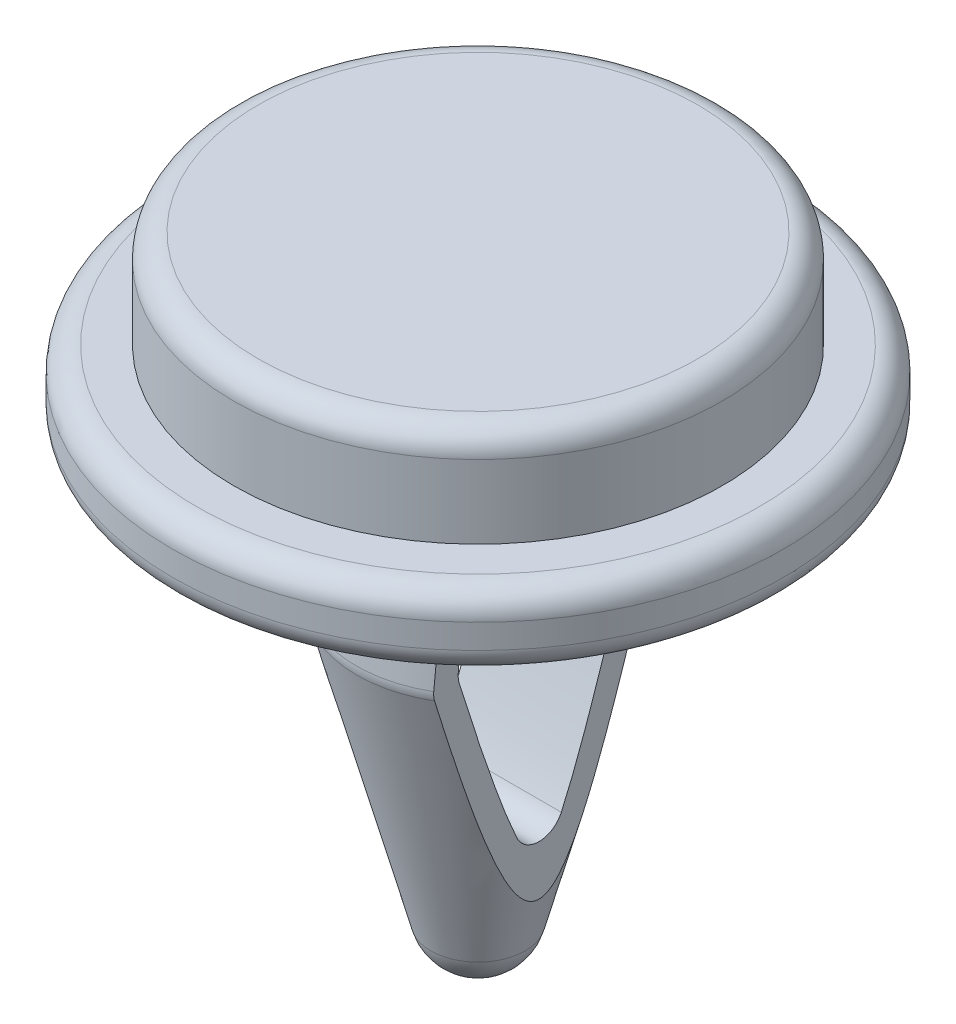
ISO-10303-21;
HEADER;
FILE_DESCRIPTION(('STEP AP214'),'2;1');
FILE_NAME('part.step','',(''),(''),'','','');
FILE_SCHEMA(('AUTOMOTIVE_DESIGN { 1 0 10303 214 1 1 1 1 }'));
ENDSEC;
DATA;
#1=APPLICATION_CONTEXT('core data for automotive mechanical design processes');
#2=APPLICATION_PROTOCOL_DEFINITION('international standard','automotive_design',2000,#1);
#3=PRODUCT_CONTEXT('',#1,'mechanical');
#4=PRODUCT('Part','Part','',(#3));
#5=PRODUCT_RELATED_PRODUCT_CATEGORY('part','',(#4));
#6=PRODUCT_DEFINITION_FORMATION('','',#4);
#7=PRODUCT_DEFINITION_CONTEXT('part definition',#1,'design');
#8=PRODUCT_DEFINITION('design','',#6,#7);
#9=PRODUCT_DEFINITION_SHAPE('','',#8);
#10=(LENGTH_UNIT() NAMED_UNIT(*) SI_UNIT(.MILLI.,.METRE.));
#11=(NAMED_UNIT(*) PLANE_ANGLE_UNIT() SI_UNIT($,.RADIAN.));
#12=(NAMED_UNIT(*) SI_UNIT($,.STERADIAN.) SOLID_ANGLE_UNIT());
#13=UNCERTAINTY_MEASURE_WITH_UNIT(LENGTH_MEASURE(1.E-05),#10,'distance_accuracy_value','');
#14=(GEOMETRIC_REPRESENTATION_CONTEXT(3) GLOBAL_UNCERTAINTY_ASSIGNED_CONTEXT((#13)) GLOBAL_UNIT_ASSIGNED_CONTEXT((#10,
#11,#12)) REPRESENTATION_CONTEXT('',''));
#15=CARTESIAN_POINT('',(0.,0.,0.));
#16=DIRECTION('',(0.,0.,1.));
#17=DIRECTION('',(1.,0.,0.));
#18=AXIS2_PLACEMENT_3D('',#15,#16,#17);
#19=CARTESIAN_POINT('',(0.,-3.0335762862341,0.));
#20=DIRECTION('',(0.,-1.,0.));
#21=DIRECTION('',(0.,0.,-1.));
#22=AXIS2_PLACEMENT_3D('',#19,#20,#21);
#23=CONICAL_SURFACE('',#22,2.5,0.0872664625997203);
#24=CARTESIAN_POINT('',(-1.25,-6.70454681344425,-2.52912842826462));
#25=CARTESIAN_POINT('',(-1.25,-5.96248165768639,-2.45667749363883));
#26=CARTESIAN_POINT('',(-1.25,-5.22046872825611,-2.38368187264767));
#27=CARTESIAN_POINT('',(-1.25,-3.73660944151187,-2.23608902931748));
#28=CARTESIAN_POINT('',(-1.25,-2.9947630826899,-2.16149182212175));
#29=CARTESIAN_POINT('',(-1.25,-1.51128086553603,-2.01018180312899));
#30=CARTESIAN_POINT('',(-1.25,-0.769645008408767,-1.93346897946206));
#31=CARTESIAN_POINT('',(-1.25,0.342573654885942,-1.81613559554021));
#32=CARTESIAN_POINT('',(-1.25,0.713275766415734,-1.77664691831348));
#33=CARTESIAN_POINT('',(-1.25,1.4545798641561,-1.69673446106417));
#34=CARTESIAN_POINT('',(-1.25,1.82518185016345,-1.65631067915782));
#35=CARTESIAN_POINT('',(-1.25,2.19572273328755,-1.61532917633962));
#36=B_SPLINE_CURVE_WITH_KNOTS('',3,(#24,#25,#26,#27,#28,#29,#30,#31,#32,#33,#34,#35),
.UNSPECIFIED.,.F.,.F.,(4,2,2,2,2,4),(0.,2.23678198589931,4.47354283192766,6.71031623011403,
7.82871345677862,8.94711293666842),.UNSPECIFIED.);
#37=CARTESIAN_POINT('',(-1.25,-2.94574828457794,-2.15618627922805));
#38=VERTEX_POINT('',#37);
#39=CARTESIAN_POINT('',(-1.25,-0.543577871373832,-1.90937790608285));
#40=VERTEX_POINT('',#39);
#41=EDGE_CURVE('E421',#38,#40,#36,.T.);
#42=ORIENTED_EDGE('',*,*,#41,.T.);
#43=CARTESIAN_POINT('',(0.,-0.543577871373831,0.));
#44=DIRECTION('',(0.,-1.,0.));
#45=DIRECTION('',(0.,0.,-1.));
#46=AXIS2_PLACEMENT_3D('',#43,#44,#45);
#47=CIRCLE('',#46,2.2821533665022);
#48=CARTESIAN_POINT('',(1.25,-0.543577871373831,-1.90937790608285));
#49=VERTEX_POINT('',#48);
#50=EDGE_CURVE('E468',#40,#49,#47,.T.);
#51=ORIENTED_EDGE('',*,*,#50,.T.);
#52=CARTESIAN_POINT('',(1.25,2.19572273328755,-1.61532917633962));
#53=CARTESIAN_POINT('',(1.25,1.88449086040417,-1.64975444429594));
#54=CARTESIAN_POINT('',(1.25,1.57321536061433,-1.6837821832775));
#55=CARTESIAN_POINT('',(1.25,0.950591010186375,-1.75115663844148));
#56=CARTESIAN_POINT('',(1.25,0.6392421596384,-1.78450335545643));
#57=CARTESIAN_POINT('',(1.25,-0.294891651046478,-1.88369282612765));
#58=CARTESIAN_POINT('',(1.25,-0.9177669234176,-1.94868523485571));
#59=CARTESIAN_POINT('',(1.25,-1.77814800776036,-2.03728929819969));
#60=CARTESIAN_POINT('',(1.25,-2.01558047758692,-2.06161758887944));
#61=CARTESIAN_POINT('',(1.25,-2.99476640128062,-2.16149534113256));
#62=CARTESIAN_POINT('',(1.25,-3.73661714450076,-2.23609139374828));
#63=CARTESIAN_POINT('',(1.25,-5.22047714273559,-2.38368111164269));
#64=CARTESIAN_POINT('',(1.25,-5.96248639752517,-2.4566747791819));
#65=CARTESIAN_POINT('',(1.25,-6.70454681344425,-2.52912842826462));
#66=B_SPLINE_CURVE_WITH_KNOTS('',3,(#52,#53,#54,#55,#56,#57,#58,#59,#60,#61,#62,#63,#64,#65),
.UNSPECIFIED.,.F.,.F.,(4,2,2,2,2,2,4),(0.,0.939389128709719,1.87877710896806,3.75754385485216,
4.47357063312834,6.71034362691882,8.94711346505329),.UNSPECIFIED.);
#67=CARTESIAN_POINT('',(1.25,-2.94574828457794,-2.15618627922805));
#68=VERTEX_POINT('',#67);
#69=EDGE_CURVE('E249',#49,#68,#66,.T.);
#70=ORIENTED_EDGE('',*,*,#69,.T.);
#71=CARTESIAN_POINT('',(0.,-2.94574828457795,0.));
#72=DIRECTION('',(0.,1.,0.));
#73=DIRECTION('',(0.,0.,1.));
#74=AXIS2_PLACEMENT_3D('',#71,#72,#73);
#75=CIRCLE('',#74,2.49231604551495);
#76=EDGE_CURVE('E469',#68,#38,#75,.T.);
#77=ORIENTED_EDGE('',*,*,#76,.T.);
#78=EDGE_LOOP('',(#42,#51,#70,#77));
#79=FACE_BOUND('',#78,.T.);
#80=ADVANCED_FACE('F36',(#79),#23,.T.);
#81=CARTESIAN_POINT('',(0.,3.5,0.));
#82=DIRECTION('',(0.,-1.,0.));
#83=DIRECTION('',(0.,0.,-1.));
#84=AXIS2_PLACEMENT_3D('',#81,#82,#83);
#85=PLANE('',#84);
#86=CARTESIAN_POINT('',(0.,3.5,0.));
#87=DIRECTION('',(0.,-1.,0.));
#88=DIRECTION('',(0.,0.,-1.));
#89=AXIS2_PLACEMENT_3D('',#86,#87,#88);
#90=CIRCLE('',#89,4.5);
#91=CARTESIAN_POINT('',(0.,3.5,-4.5));
#92=VERTEX_POINT('',#91);
#93=EDGE_CURVE('E538',#92,#92,#90,.F.);
#94=ORIENTED_EDGE('',*,*,#93,.T.);
#95=EDGE_LOOP('',(#94));
#96=FACE_BOUND('',#95,.T.);
#97=ADVANCED_FACE('F38',(#96),#85,.F.);
#98=CARTESIAN_POINT('',(0.,0.,0.));
#99=DIRECTION('',(0.,1.,0.));
#100=DIRECTION('',(0.,0.,1.));
#101=AXIS2_PLACEMENT_3D('',#98,#99,#100);
#102=CYLINDRICAL_SURFACE('',#101,5.);
#103=CARTESIAN_POINT('',(0.,3.,0.));
#104=DIRECTION('',(0.,-1.,0.));
#105=DIRECTION('',(0.,0.,-1.));
#106=AXIS2_PLACEMENT_3D('',#103,#104,#105);
#107=CIRCLE('',#106,5.);
#108=CARTESIAN_POINT('',(0.,3.,-5.));
#109=VERTEX_POINT('',#108);
#110=EDGE_CURVE('E521',#109,#109,#107,.T.);
#111=ORIENTED_EDGE('',*,*,#110,.T.);
#112=EDGE_LOOP('',(#111));
#113=FACE_BOUND('',#112,.T.);
#114=CARTESIAN_POINT('',(0.,1.5,0.));
#115=DIRECTION('',(0.,1.,0.));
#116=DIRECTION('',(0.,0.,1.));
#117=AXIS2_PLACEMENT_3D('',#114,#115,#116);
#118=CIRCLE('',#117,5.);
#119=CARTESIAN_POINT('',(0.,1.5,5.));
#120=VERTEX_POINT('',#119);
#121=EDGE_CURVE('E789',#120,#120,#118,.T.);
#122=ORIENTED_EDGE('',*,*,#121,.T.);
#123=EDGE_LOOP('',(#122));
#124=FACE_BOUND('',#123,.T.);
#125=ADVANCED_FACE('F453',(#113,#124),#102,.T.);
#126=CARTESIAN_POINT('',(5.,1.5,0.));
#127=DIRECTION('',(0.,-1.,0.));
#128=DIRECTION('',(0.,0.,-1.));
#129=AXIS2_PLACEMENT_3D('',#126,#127,#128);
#130=PLANE('',#129);
#131=CARTESIAN_POINT('',(0.,1.5,0.));
#132=DIRECTION('',(0.,-1.,0.));
#133=DIRECTION('',(0.,0.,-1.));
#134=AXIS2_PLACEMENT_3D('',#131,#132,#133);
#135=CIRCLE('',#134,5.75);
#136=CARTESIAN_POINT('',(0.,1.5,-5.75));
#137=VERTEX_POINT('',#136);
#138=EDGE_CURVE('E514',#137,#137,#135,.F.);
#139=ORIENTED_EDGE('',*,*,#138,.T.);
#140=EDGE_LOOP('',(#139));
#141=FACE_BOUND('',#140,.T.);
#142=ORIENTED_EDGE('',*,*,#121,.F.);
#143=EDGE_LOOP('',(#142));
#144=FACE_BOUND('',#143,.T.);
#145=ADVANCED_FACE('F450',(#141,#144),#130,.F.);
#146=CARTESIAN_POINT('',(0.,0.,0.));
#147=DIRECTION('',(0.,1.,0.));
#148=DIRECTION('',(0.,0.,1.));
#149=AXIS2_PLACEMENT_3D('',#146,#147,#148);
#150=CYLINDRICAL_SURFACE('',#149,6.25);
#151=CARTESIAN_POINT('',(0.,0.5,0.));
#152=DIRECTION('',(0.,1.,0.));
#153=DIRECTION('',(0.,0.,1.));
#154=AXIS2_PLACEMENT_3D('',#151,#152,#153);
#155=CIRCLE('',#154,6.25);
#156=CARTESIAN_POINT('',(0.,0.5,6.25));
#157=VERTEX_POINT('',#156);
#158=EDGE_CURVE('E513',#157,#157,#155,.T.);
#159=ORIENTED_EDGE('',*,*,#158,.T.);
#160=EDGE_LOOP('',(#159));
#161=FACE_BOUND('',#160,.T.);
#162=CARTESIAN_POINT('',(0.,0.999999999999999,0.));
#163=DIRECTION('',(0.,-1.,0.));
#164=DIRECTION('',(0.,0.,-1.));
#165=AXIS2_PLACEMENT_3D('',#162,#163,#164);
#166=CIRCLE('',#165,6.25);
#167=CARTESIAN_POINT('',(0.,0.999999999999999,-6.25));
#168=VERTEX_POINT('',#167);
#169=EDGE_CURVE('E515',#168,#168,#166,.T.);
#170=ORIENTED_EDGE('',*,*,#169,.T.);
#171=EDGE_LOOP('',(#170));
#172=FACE_BOUND('',#171,.T.);
#173=ADVANCED_FACE('F446',(#161,#172),#150,.T.);
#174=CARTESIAN_POINT('',(6.25,0.,0.));
#175=DIRECTION('',(0.,1.,0.));
#176=DIRECTION('',(0.,0.,1.));
#177=AXIS2_PLACEMENT_3D('',#174,#175,#176);
#178=PLANE('',#177);
#179=DIRECTION('',(0.,0.,1.));
#180=VECTOR('',#179,1.);
#181=CARTESIAN_POINT('',(-1.75,0.,1.85227464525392));
#182=LINE('',#181,#180);
#183=CARTESIAN_POINT('',(-1.75,0.,-2.16039210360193));
#184=VERTEX_POINT('',#183);
#185=CARTESIAN_POINT('',(-1.75,0.,2.16039210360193));
#186=VERTEX_POINT('',#185);
#187=EDGE_CURVE('E568',#184,#186,#182,.T.);
#188=ORIENTED_EDGE('',*,*,#187,.T.);
#189=CARTESIAN_POINT('',(0.,0.,0.));
#190=DIRECTION('',(0.,1.,0.));
#191=DIRECTION('',(0.,0.,1.));
#192=AXIS2_PLACEMENT_3D('',#189,#190,#191);
#193=CIRCLE('',#192,2.78025071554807);
#194=CARTESIAN_POINT('',(1.75,0.,2.16039210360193));
#195=VERTEX_POINT('',#194);
#196=EDGE_CURVE('E564',#186,#195,#193,.T.);
#197=ORIENTED_EDGE('',*,*,#196,.T.);
#198=DIRECTION('',(0.,0.,1.));
#199=VECTOR('',#198,1.);
#200=CARTESIAN_POINT('',(1.75,0.,-1.85227464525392));
#201=LINE('',#200,#199);
#202=CARTESIAN_POINT('',(1.75,0.,-2.16039210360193));
#203=VERTEX_POINT('',#202);
#204=EDGE_CURVE('E558',#195,#203,#201,.F.);
#205=ORIENTED_EDGE('',*,*,#204,.T.);
#206=CARTESIAN_POINT('',(0.,0.,0.));
#207=DIRECTION('',(0.,1.,0.));
#208=DIRECTION('',(0.,0.,1.));
#209=AXIS2_PLACEMENT_3D('',#206,#207,#208);
#210=CIRCLE('',#209,2.78025071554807);
#211=EDGE_CURVE('E570',#203,#184,#210,.T.);
#212=ORIENTED_EDGE('',*,*,#211,.T.);
#213=EDGE_LOOP('',(#188,#197,#205,#212));
#214=FACE_BOUND('',#213,.T.);
#215=CARTESIAN_POINT('',(0.,0.,0.));
#216=DIRECTION('',(0.,1.,0.));
#217=DIRECTION('',(0.,0.,1.));
#218=AXIS2_PLACEMENT_3D('',#215,#216,#217);
#219=CIRCLE('',#218,5.75);
#220=CARTESIAN_POINT('',(0.,0.,5.75));
#221=VERTEX_POINT('',#220);
#222=EDGE_CURVE('E510',#221,#221,#219,.F.);
#223=ORIENTED_EDGE('',*,*,#222,.T.);
#224=EDGE_LOOP('',(#223));
#225=FACE_BOUND('',#224,.T.);
#226=ADVANCED_FACE('F439',(#214,#225),#178,.F.);
#227=CARTESIAN_POINT('',(1.25,-6.70454681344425,2.52912842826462));
#228=CARTESIAN_POINT('',(1.25,-5.96248165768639,2.45667749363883));
#229=CARTESIAN_POINT('',(1.25,-5.22046872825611,2.38368187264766));
#230=CARTESIAN_POINT('',(1.25,-3.73660944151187,2.23608902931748));
#231=CARTESIAN_POINT('',(1.25,-2.9947630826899,2.16149182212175));
#232=CARTESIAN_POINT('',(1.25,-1.51128086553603,2.01018180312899));
#233=CARTESIAN_POINT('',(1.25,-0.769645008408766,1.93346897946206));
#234=CARTESIAN_POINT('',(1.25,0.342573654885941,1.81613559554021));
#235=CARTESIAN_POINT('',(1.25,0.713275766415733,1.77664691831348));
#236=CARTESIAN_POINT('',(1.25,1.4545798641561,1.69673446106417));
#237=CARTESIAN_POINT('',(1.25,1.82518185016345,1.65631067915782));
#238=CARTESIAN_POINT('',(1.25,2.19572273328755,1.61532917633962));
#239=B_SPLINE_CURVE_WITH_KNOTS('',3,(#227,#228,#229,#230,#231,#232,#233,#234,#235,#236,#237,
#238),.UNSPECIFIED.,.F.,.F.,(4,2,2,2,2,4),(0.,2.23678198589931,4.47354283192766,
6.71031623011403,7.82871345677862,8.94711293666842),.UNSPECIFIED.);
#240=CARTESIAN_POINT('',(1.25,-2.94574828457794,2.15618627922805));
#241=VERTEX_POINT('',#240);
#242=CARTESIAN_POINT('',(1.25,-0.543577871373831,1.90937790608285));
#243=VERTEX_POINT('',#242);
#244=EDGE_CURVE('E241',#241,#243,#239,.T.);
#245=ORIENTED_EDGE('',*,*,#244,.T.);
#246=CARTESIAN_POINT('',(0.,-0.543577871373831,0.));
#247=DIRECTION('',(0.,-1.,0.));
#248=DIRECTION('',(0.,0.,-1.));
#249=AXIS2_PLACEMENT_3D('',#246,#247,#248);
#250=CIRCLE('',#249,2.2821533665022);
#251=CARTESIAN_POINT('',(-1.25,-0.543577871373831,1.90937790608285));
#252=VERTEX_POINT('',#251);
#253=EDGE_CURVE('E561',#243,#252,#250,.T.);
#254=ORIENTED_EDGE('',*,*,#253,.T.);
#255=CARTESIAN_POINT('',(-1.25,2.19572273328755,1.61532917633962));
#256=CARTESIAN_POINT('',(-1.25,1.88449086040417,1.64975444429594));
#257=CARTESIAN_POINT('',(-1.25,1.57321536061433,1.6837821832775));
#258=CARTESIAN_POINT('',(-1.25,0.950591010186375,1.75115663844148));
#259=CARTESIAN_POINT('',(-1.25,0.6392421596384,1.78450335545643));
#260=CARTESIAN_POINT('',(-1.25,-0.294891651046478,1.88369282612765));
#261=CARTESIAN_POINT('',(-1.25,-0.9177669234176,1.94868523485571));
#262=CARTESIAN_POINT('',(-1.25,-1.77814800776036,2.03728929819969));
#263=CARTESIAN_POINT('',(-1.25,-2.01558047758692,2.06161758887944));
#264=CARTESIAN_POINT('',(-1.25,-2.99476640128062,2.16149534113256));
#265=CARTESIAN_POINT('',(-1.25,-3.73661714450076,2.23609139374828));
#266=CARTESIAN_POINT('',(-1.25,-5.22047714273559,2.38368111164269));
#267=CARTESIAN_POINT('',(-1.25,-5.96248639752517,2.45667477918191));
#268=CARTESIAN_POINT('',(-1.25,-6.70454681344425,2.52912842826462));
#269=B_SPLINE_CURVE_WITH_KNOTS('',3,(#255,#256,#257,#258,#259,#260,#261,#262,#263,#264,#265,
#266,#267,#268),.UNSPECIFIED.,.F.,.F.,(4,2,2,2,2,2,4),(0.,0.939389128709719,1.87877710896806,
3.75754385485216,4.47357063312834,6.71034362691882,8.9471134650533),.UNSPECIFIED.);
#270=CARTESIAN_POINT('',(-1.25,-2.94574828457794,2.15618627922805));
#271=VERTEX_POINT('',#270);
#272=EDGE_CURVE('E415',#252,#271,#269,.T.);
#273=ORIENTED_EDGE('',*,*,#272,.T.);
#274=CARTESIAN_POINT('',(0.,-2.94574828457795,0.));
#275=DIRECTION('',(0.,1.,0.));
#276=DIRECTION('',(0.,0.,1.));
#277=AXIS2_PLACEMENT_3D('',#274,#275,#276);
#278=CIRCLE('',#277,2.49231604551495);
#279=EDGE_CURVE('E563',#271,#241,#278,.T.);
#280=ORIENTED_EDGE('',*,*,#279,.T.);
#281=EDGE_LOOP('',(#245,#254,#273,#280));
#282=FACE_BOUND('',#281,.T.);
#283=ADVANCED_FACE('F434',(#282),#23,.T.);
#284=CARTESIAN_POINT('',(0.,-8.75881904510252,0.));
#285=DIRECTION('',(0.,1.,0.));
#286=DIRECTION('',(0.,0.,1.));
#287=AXIS2_PLACEMENT_3D('',#284,#285,#286);
#288=CONICAL_SURFACE('',#287,0.965925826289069,0.26179938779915);
#289=CARTESIAN_POINT('',(-1.25,1.26320370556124,-3.43068921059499));
#290=CARTESIAN_POINT('',(-1.25,1.03145630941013,-3.36459775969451));
#291=CARTESIAN_POINT('',(-1.25,0.799767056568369,-3.29830308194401));
#292=CARTESIAN_POINT('',(-1.25,0.336529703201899,-3.1652173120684));
#293=CARTESIAN_POINT('',(-1.25,0.104981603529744,-3.09842621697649));
#294=CARTESIAN_POINT('',(-1.25,-0.589521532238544,-2.89714208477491));
#295=CARTESIAN_POINT('',(-1.25,-1.05222321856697,-2.7617701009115));
#296=CARTESIAN_POINT('',(-1.25,-1.74686929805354,-2.55560071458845));
#297=CARTESIAN_POINT('',(-1.25,-1.97921230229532,-2.48614670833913));
#298=CARTESIAN_POINT('',(-1.25,-2.4435444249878,-2.34606671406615));
#299=CARTESIAN_POINT('',(-1.25,-2.67553354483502,-2.2754407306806));
#300=CARTESIAN_POINT('',(-1.25,-3.13901580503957,-2.13266878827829));
#301=CARTESIAN_POINT('',(-1.25,-3.37050899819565,-2.06052300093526));
#302=CARTESIAN_POINT('',(-1.25,-3.83284407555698,-1.91417775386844));
#303=CARTESIAN_POINT('',(-1.25,-4.06368597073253,-1.83997832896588));
#304=CARTESIAN_POINT('',(-1.25,-4.45509518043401,-1.71144277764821));
#305=CARTESIAN_POINT('',(-1.25,-4.61590573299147,-1.65784850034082));
#306=CARTESIAN_POINT('',(-1.25,-4.93690931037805,-1.5487875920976));
#307=CARTESIAN_POINT('',(-1.25,-5.0971022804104,-1.49332079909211));
#308=CARTESIAN_POINT('',(-1.25,-5.41634555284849,-1.37993118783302));
#309=CARTESIAN_POINT('',(-1.25,-5.57539722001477,-1.32201222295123));
#310=CARTESIAN_POINT('',(-1.25,-5.89213451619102,-1.20258981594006));
#311=CARTESIAN_POINT('',(-1.25,-6.04982040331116,-1.14108706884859));
#312=CARTESIAN_POINT('',(-1.25,-6.28403345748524,-1.04491792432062));
#313=CARTESIAN_POINT('',(-1.25,-6.36141829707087,-1.01234488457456));
#314=CARTESIAN_POINT('',(-1.25,-6.5154409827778,-0.945412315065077));
#315=CARTESIAN_POINT('',(-1.25,-6.59207863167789,-0.911052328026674));
#316=CARTESIAN_POINT('',(-1.25,-6.74450073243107,-0.839861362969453));
#317=CARTESIAN_POINT('',(-1.25,-6.82028167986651,-0.803022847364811));
#318=CARTESIAN_POINT('',(-1.25,-6.97014593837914,-0.726078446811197));
#319=CARTESIAN_POINT('',(-1.25,-7.04423025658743,-0.685974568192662));
#320=CARTESIAN_POINT('',(-1.25,-7.15398367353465,-0.621704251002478));
#321=CARTESIAN_POINT('',(-1.25,-7.19070729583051,-0.59934461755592));
#322=CARTESIAN_POINT('',(-1.25,-7.26311098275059,-0.553003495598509));
#323=CARTESIAN_POINT('',(-1.25,-7.29879139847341,-0.529022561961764));
#324=CARTESIAN_POINT('',(-1.25,-7.36845615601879,-0.479105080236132));
#325=CARTESIAN_POINT('',(-1.25,-7.40244912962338,-0.45318067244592));
#326=CARTESIAN_POINT('',(-1.25,-7.46814690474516,-0.398604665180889));
#327=CARTESIAN_POINT('',(-1.25,-7.4998555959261,-0.369957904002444));
#328=CARTESIAN_POINT('',(-1.25,-7.54419432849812,-0.324613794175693));
#329=CARTESIAN_POINT('',(-1.25,-7.55826380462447,-0.309329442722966));
#330=CARTESIAN_POINT('',(-1.25,-7.58523489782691,-0.277719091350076));
#331=CARTESIAN_POINT('',(-1.25,-7.59813501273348,-0.261391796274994));
#332=CARTESIAN_POINT('',(-1.25,-7.62417531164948,-0.225042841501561));
#333=CARTESIAN_POINT('',(-1.25,-7.63706043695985,-0.204834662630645));
#334=CARTESIAN_POINT('',(-1.25,-7.6598790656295,-0.162797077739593));
#335=CARTESIAN_POINT('',(-1.25,-7.66981620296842,-0.140969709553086));
#336=CARTESIAN_POINT('',(-1.25,-7.68434760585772,-0.0996800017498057));
#337=CARTESIAN_POINT('',(-1.25,-7.68956037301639,-0.0804397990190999));
#338=CARTESIAN_POINT('',(-1.25,-7.69665247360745,-0.041360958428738));
#339=CARTESIAN_POINT('',(-1.25,-7.69853641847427,-0.0215231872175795));
#340=CARTESIAN_POINT('',(-1.25,-7.69873499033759,0.0182120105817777));
#341=CARTESIAN_POINT('',(-1.25,-7.69704228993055,0.0381094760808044));
#342=CARTESIAN_POINT('',(-1.25,-7.6902957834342,0.0773297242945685));
#343=CARTESIAN_POINT('',(-1.25,-7.68523769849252,0.096651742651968));
#344=CARTESIAN_POINT('',(-1.25,-7.66999689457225,0.141049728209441));
#345=CARTESIAN_POINT('',(-1.25,-7.65862838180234,0.165712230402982));
#346=CARTESIAN_POINT('',(-1.25,-7.6322208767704,0.212973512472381));
#347=CARTESIAN_POINT('',(-1.25,-7.61717246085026,0.235566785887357));
#348=CARTESIAN_POINT('',(-1.25,-7.56974110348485,0.298665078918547));
#349=CARTESIAN_POINT('',(-1.25,-7.53408678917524,0.336664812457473));
#350=CARTESIAN_POINT('',(-1.25,-7.4582779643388,0.407817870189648));
#351=CARTESIAN_POINT('',(-1.25,-7.41810729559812,0.440952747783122));
#352=CARTESIAN_POINT('',(-1.25,-7.33569442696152,0.503412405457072));
#353=CARTESIAN_POINT('',(-1.25,-7.29348322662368,0.532778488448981));
#354=CARTESIAN_POINT('',(-1.25,-7.20745405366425,0.589074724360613));
#355=CARTESIAN_POINT('',(-1.25,-7.16363498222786,0.616003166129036));
#356=CARTESIAN_POINT('',(-1.25,-7.03038947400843,0.694175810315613));
#357=CARTESIAN_POINT('',(-1.25,-6.93936255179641,0.742675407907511));
#358=CARTESIAN_POINT('',(-1.25,-6.75461497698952,0.835390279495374));
#359=CARTESIAN_POINT('',(-1.25,-6.66088254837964,0.879581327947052));
#360=CARTESIAN_POINT('',(-1.25,-6.47215204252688,0.964761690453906));
#361=CARTESIAN_POINT('',(-1.25,-6.37715611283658,1.00575578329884));
#362=CARTESIAN_POINT('',(-1.25,-6.18752200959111,1.08494683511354));
#363=CARTESIAN_POINT('',(-1.25,-6.09289639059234,1.12317413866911));
#364=CARTESIAN_POINT('',(-1.25,-5.90298590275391,1.19795948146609));
#365=CARTESIAN_POINT('',(-1.25,-5.80770100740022,1.23451745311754));
#366=CARTESIAN_POINT('',(-1.25,-5.52108387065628,1.34226956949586));
#367=CARTESIAN_POINT('',(-1.25,-5.32902522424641,1.41152724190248));
#368=CARTESIAN_POINT('',(-1.25,-4.94350840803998,1.54675904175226));
#369=CARTESIAN_POINT('',(-1.25,-4.75004882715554,1.61272909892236));
#370=CARTESIAN_POINT('',(-1.25,-4.36235657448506,1.74227934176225));
#371=CARTESIAN_POINT('',(-1.25,-4.16812398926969,1.80585978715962));
#372=CARTESIAN_POINT('',(-1.25,-3.78002311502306,1.93097275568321));
#373=CARTESIAN_POINT('',(-1.25,-3.58615749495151,1.99251358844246));
#374=CARTESIAN_POINT('',(-1.25,-3.19800614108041,2.11427173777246));
#375=CARTESIAN_POINT('',(-1.25,-3.00372039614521,2.17448901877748));
#376=CARTESIAN_POINT('',(-1.25,-2.42062598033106,2.35352709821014));
#377=CARTESIAN_POINT('',(-1.25,-2.03134532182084,2.47080895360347));
#378=CARTESIAN_POINT('',(-1.25,-1.08104384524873,2.75361317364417));
#379=CARTESIAN_POINT('',(-1.25,-0.519605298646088,2.91772536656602));
#380=CARTESIAN_POINT('',(-1.25,0.604219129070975,3.24268873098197));
#381=CARTESIAN_POINT('',(-1.25,1.16660502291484,3.40353985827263));
#382=CARTESIAN_POINT('',(-1.25,2.29215297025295,3.72314609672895));
#383=CARTESIAN_POINT('',(-1.25,2.85531520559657,3.88190056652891));
#384=CARTESIAN_POINT('',(-1.25,3.98205127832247,4.19792786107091));
#385=CARTESIAN_POINT('',(-1.25,4.54562511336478,4.35520069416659));
#386=CARTESIAN_POINT('',(-1.25,5.67567725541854,4.66940205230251));
#387=CARTESIAN_POINT('',(-1.25,6.24215693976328,4.82632562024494));
#388=CARTESIAN_POINT('',(-1.25,7.37533954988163,5.13936847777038));
#389=CARTESIAN_POINT('',(-1.25,7.94204247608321,5.29548776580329));
#390=CARTESIAN_POINT('',(-1.25,9.07541093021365,5.6070552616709));
#391=CARTESIAN_POINT('',(-1.25,9.6420763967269,5.76250369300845));
#392=CARTESIAN_POINT('',(-1.25,10.7755394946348,6.07291188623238));
#393=CARTESIAN_POINT('',(-1.25,11.3423371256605,6.22787164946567));
#394=CARTESIAN_POINT('',(-1.25,11.9091841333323,6.38265014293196));
#395=B_SPLINE_CURVE_WITH_KNOTS('',3,(#289,#290,#291,#292,#293,#294,#295,#296,#297,#298,#299,
#300,#301,#302,#303,#304,#305,#306,#307,#308,#309,#310,#311,#312,#313,#314,#315,#316,#317,#318,
#319,#320,#321,#322,#323,#324,#325,#326,#327,#328,#329,#330,#331,#332,#333,#334,#335,#336,#337,
#338,#339,#340,#341,#342,#343,#344,#345,#346,#347,#348,#349,#350,#351,#352,#353,#354,#355,#356,
#357,#358,#359,#360,#361,#362,#363,#364,#365,#366,#367,#368,#369,#370,#371,#372,#373,#374,#375,
#376,#377,#378,#379,#380,#381,#382,#383,#384,#385,#386,#387,#388,#389,#390,#391,#392,#393,#394),
.UNSPECIFIED.,.F.,.F.,(4,2,2,2,2,2,2,2,2,2,2,2,2,2,2,2,2,2,2,2,2,2,2,2,2,2,2,2,2,2,2,2,2,2,2,2,
2,2,2,2,2,2,2,2,2,2,2,2,2,2,2,2,4),(0.,0.722961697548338,1.4459277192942,2.8922096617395,
3.61971293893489,4.34721333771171,5.07463199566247,5.80203832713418,6.31054932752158,
6.81910445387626,7.32688811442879,7.83457362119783,8.08644057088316,8.33837229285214,
8.5911082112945,8.84368999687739,8.97264511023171,9.10155631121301,9.22972034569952,
9.35766071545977,9.41993756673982,9.48229331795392,9.55401644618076,9.62565079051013,
9.68520160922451,9.7446698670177,9.8042600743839,9.86392619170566,9.94493054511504,
10.026144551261,10.1815961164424,10.3376226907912,10.4917586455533,10.6460019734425,
10.9551746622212,11.2659960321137,11.5763435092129,11.882491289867,12.188651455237,
12.8010884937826,13.4142658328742,14.0273763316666,14.6375675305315,15.2477751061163,
16.4674509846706,18.222231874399,19.9770365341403,21.7323661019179,23.4876857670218,
25.2511242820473,27.0145661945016,28.7773664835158,30.5401619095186),.UNSPECIFIED.);
#396=CARTESIAN_POINT('',(-1.25,-3.11873567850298,2.13867452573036));
#397=VERTEX_POINT('',#396);
#398=CARTESIAN_POINT('',(-1.25,-3.11873567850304,-2.13867452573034));
#399=VERTEX_POINT('',#398);
#400=EDGE_CURVE('E532',#397,#399,#395,.F.);
#401=ORIENTED_EDGE('',*,*,#400,.T.);
#402=CARTESIAN_POINT('',(0.,-3.11873567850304,0.));
#403=DIRECTION('',(0.,-1.,0.));
#404=DIRECTION('',(0.,0.,-1.));
#405=AXIS2_PLACEMENT_3D('',#402,#403,#404);
#406=CIRCLE('',#405,2.47718160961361);
#407=CARTESIAN_POINT('',(1.25,-3.11873567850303,-2.13867452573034));
#408=VERTEX_POINT('',#407);
#409=EDGE_CURVE('E293',#399,#408,#406,.T.);
#410=ORIENTED_EDGE('',*,*,#409,.T.);
#411=CARTESIAN_POINT('',(1.25,1.2632037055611,-3.43068921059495));
#412=CARTESIAN_POINT('',(1.25,1.03145630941,-3.36459775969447));
#413=CARTESIAN_POINT('',(1.25,0.799767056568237,-3.29830308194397));
#414=CARTESIAN_POINT('',(1.25,0.336529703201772,-3.16521731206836));
#415=CARTESIAN_POINT('',(1.25,0.10498160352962,-3.09842621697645));
#416=CARTESIAN_POINT('',(1.25,-0.589521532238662,-2.89714208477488));
#417=CARTESIAN_POINT('',(1.25,-1.05222321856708,-2.76177010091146));
#418=CARTESIAN_POINT('',(1.25,-1.74686929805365,-2.55560071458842));
#419=CARTESIAN_POINT('',(1.25,-1.97921230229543,-2.4861467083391));
#420=CARTESIAN_POINT('',(1.25,-2.4435444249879,-2.34606671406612));
#421=CARTESIAN_POINT('',(1.25,-2.67553354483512,-2.27544073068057));
#422=CARTESIAN_POINT('',(1.25,-3.13901580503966,-2.13266878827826));
#423=CARTESIAN_POINT('',(1.25,-3.37050899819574,-2.06052300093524));
#424=CARTESIAN_POINT('',(1.25,-3.83284407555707,-1.91417775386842));
#425=CARTESIAN_POINT('',(1.25,-4.06368597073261,-1.83997832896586));
#426=CARTESIAN_POINT('',(1.25,-4.45509518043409,-1.71144277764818));
#427=CARTESIAN_POINT('',(1.25,-4.61590573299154,-1.65784850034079));
#428=CARTESIAN_POINT('',(1.25,-4.93690931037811,-1.54878759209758));
#429=CARTESIAN_POINT('',(1.25,-5.09710228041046,-1.4933207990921));
#430=CARTESIAN_POINT('',(1.25,-5.41634555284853,-1.379931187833));
#431=CARTESIAN_POINT('',(1.25,-5.57539722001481,-1.32201222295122));
#432=CARTESIAN_POINT('',(1.25,-5.89213451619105,-1.20258981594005));
#433=CARTESIAN_POINT('',(1.25,-6.04982040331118,-1.14108706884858));
#434=CARTESIAN_POINT('',(1.25,-6.28403345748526,-1.04491792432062));
#435=CARTESIAN_POINT('',(1.25,-6.36141829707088,-1.01234488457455));
#436=CARTESIAN_POINT('',(1.25,-6.51544098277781,-0.945412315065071));
#437=CARTESIAN_POINT('',(1.25,-6.5920786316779,-0.911052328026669));
#438=CARTESIAN_POINT('',(1.25,-6.74450073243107,-0.83986136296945));
#439=CARTESIAN_POINT('',(1.25,-6.82028167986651,-0.803022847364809));
#440=CARTESIAN_POINT('',(1.25,-6.97014593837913,-0.726078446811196));
#441=CARTESIAN_POINT('',(1.25,-7.04423025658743,-0.685974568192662));
#442=CARTESIAN_POINT('',(1.25,-7.15398367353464,-0.62170425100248));
#443=CARTESIAN_POINT('',(1.25,-7.19070729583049,-0.599344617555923));
#444=CARTESIAN_POINT('',(1.25,-7.26311098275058,-0.553003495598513));
#445=CARTESIAN_POINT('',(1.25,-7.2987913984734,-0.529022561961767));
#446=CARTESIAN_POINT('',(1.25,-7.36845615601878,-0.479105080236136));
#447=CARTESIAN_POINT('',(1.25,-7.40244912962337,-0.453180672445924));
#448=CARTESIAN_POINT('',(1.25,-7.46814690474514,-0.398604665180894));
#449=CARTESIAN_POINT('',(1.25,-7.49985559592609,-0.369957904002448));
#450=CARTESIAN_POINT('',(1.25,-7.54419432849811,-0.324613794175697));
#451=CARTESIAN_POINT('',(1.25,-7.55826380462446,-0.309329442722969));
#452=CARTESIAN_POINT('',(1.25,-7.58523489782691,-0.277719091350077));
#453=CARTESIAN_POINT('',(1.25,-7.59813501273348,-0.261391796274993));
#454=CARTESIAN_POINT('',(1.25,-7.62417531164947,-0.225042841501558));
#455=CARTESIAN_POINT('',(1.25,-7.63706043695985,-0.204834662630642));
#456=CARTESIAN_POINT('',(1.25,-7.6598790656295,-0.162797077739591));
#457=CARTESIAN_POINT('',(1.25,-7.66981620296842,-0.140969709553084));
#458=CARTESIAN_POINT('',(1.25,-7.68434760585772,-0.0996800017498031));
#459=CARTESIAN_POINT('',(1.25,-7.68956037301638,-0.0804397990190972));
#460=CARTESIAN_POINT('',(1.25,-7.69665247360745,-0.0413609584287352));
#461=CARTESIAN_POINT('',(1.25,-7.69853641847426,-0.0215231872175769));
#462=CARTESIAN_POINT('',(1.25,-7.69873499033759,0.0182120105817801));
#463=CARTESIAN_POINT('',(1.25,-7.69704228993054,0.0381094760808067));
#464=CARTESIAN_POINT('',(1.25,-7.69029578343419,0.0773297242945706));
#465=CARTESIAN_POINT('',(1.25,-7.68523769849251,0.0966517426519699));
#466=CARTESIAN_POINT('',(1.25,-7.66999689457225,0.141049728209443));
#467=CARTESIAN_POINT('',(1.25,-7.65862838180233,0.165712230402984));
#468=CARTESIAN_POINT('',(1.25,-7.63222087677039,0.212973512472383));
#469=CARTESIAN_POINT('',(1.25,-7.61717246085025,0.23556678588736));
#470=CARTESIAN_POINT('',(1.25,-7.56974110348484,0.298665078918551));
#471=CARTESIAN_POINT('',(1.25,-7.53408678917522,0.336664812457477));
#472=CARTESIAN_POINT('',(1.25,-7.45827796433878,0.407817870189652));
#473=CARTESIAN_POINT('',(1.25,-7.41810729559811,0.440952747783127));
#474=CARTESIAN_POINT('',(1.25,-7.33569442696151,0.503412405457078));
#475=CARTESIAN_POINT('',(1.25,-7.29348322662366,0.532778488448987));
#476=CARTESIAN_POINT('',(1.25,-7.20745405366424,0.58907472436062));
#477=CARTESIAN_POINT('',(1.25,-7.16363498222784,0.616003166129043));
#478=CARTESIAN_POINT('',(1.25,-7.0303894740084,0.694175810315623));
#479=CARTESIAN_POINT('',(1.25,-6.93936255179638,0.742675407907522));
#480=CARTESIAN_POINT('',(1.25,-6.75461497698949,0.835390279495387));
#481=CARTESIAN_POINT('',(1.25,-6.66088254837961,0.879581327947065));
#482=CARTESIAN_POINT('',(1.25,-6.47215204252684,0.96476169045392));
#483=CARTESIAN_POINT('',(1.25,-6.37715611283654,1.00575578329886));
#484=CARTESIAN_POINT('',(1.25,-6.18752200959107,1.08494683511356));
#485=CARTESIAN_POINT('',(1.25,-6.09289639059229,1.12317413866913));
#486=CARTESIAN_POINT('',(1.25,-5.90298590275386,1.19795948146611));
#487=CARTESIAN_POINT('',(1.25,-5.80770100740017,1.23451745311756));
#488=CARTESIAN_POINT('',(1.25,-5.52108387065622,1.34226956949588));
#489=CARTESIAN_POINT('',(1.25,-5.32902522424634,1.4115272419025));
#490=CARTESIAN_POINT('',(1.25,-4.94350840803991,1.54675904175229));
#491=CARTESIAN_POINT('',(1.25,-4.75004882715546,1.61272909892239));
#492=CARTESIAN_POINT('',(1.25,-4.36235657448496,1.74227934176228));
#493=CARTESIAN_POINT('',(1.25,-4.16812398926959,1.80585978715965));
#494=CARTESIAN_POINT('',(1.25,-3.78002311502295,1.93097275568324));
#495=CARTESIAN_POINT('',(1.25,-3.5861574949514,1.99251358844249));
#496=CARTESIAN_POINT('',(1.25,-3.19800614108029,2.1142717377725));
#497=CARTESIAN_POINT('',(1.25,-3.00372039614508,2.17448901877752));
#498=CARTESIAN_POINT('',(1.25,-2.42062598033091,2.35352709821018));
#499=CARTESIAN_POINT('',(1.25,-2.03134532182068,2.47080895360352));
#500=CARTESIAN_POINT('',(1.25,-1.08104384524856,2.75361317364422));
#501=CARTESIAN_POINT('',(1.25,-0.519605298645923,2.91772536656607));
#502=CARTESIAN_POINT('',(1.25,0.60421912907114,3.24268873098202));
#503=CARTESIAN_POINT('',(1.25,1.166605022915,3.40353985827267));
#504=CARTESIAN_POINT('',(1.25,2.29215297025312,3.723146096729));
#505=CARTESIAN_POINT('',(1.25,2.85531520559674,3.88190056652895));
#506=CARTESIAN_POINT('',(1.25,3.98205127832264,4.19792786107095));
#507=CARTESIAN_POINT('',(1.25,4.54562511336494,4.35520069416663));
#508=CARTESIAN_POINT('',(1.25,5.6756772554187,4.66940205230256));
#509=CARTESIAN_POINT('',(1.25,6.24215693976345,4.82632562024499));
#510=CARTESIAN_POINT('',(1.25,7.3753395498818,5.13936847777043));
#511=CARTESIAN_POINT('',(1.25,7.94204247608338,5.29548776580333));
#512=CARTESIAN_POINT('',(1.25,9.07541093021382,5.60705526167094));
#513=CARTESIAN_POINT('',(1.25,9.64207639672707,5.76250369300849));
#514=CARTESIAN_POINT('',(1.25,10.7755394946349,6.07291188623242));
#515=CARTESIAN_POINT('',(1.25,11.3423371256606,6.22787164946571));
#516=CARTESIAN_POINT('',(1.25,11.9091841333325,6.382650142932));
#517=B_SPLINE_CURVE_WITH_KNOTS('',3,(#411,#412,#413,#414,#415,#416,#417,#418,#419,#420,#421,
#422,#423,#424,#425,#426,#427,#428,#429,#430,#431,#432,#433,#434,#435,#436,#437,#438,#439,#440,
#441,#442,#443,#444,#445,#446,#447,#448,#449,#450,#451,#452,#453,#454,#455,#456,#457,#458,#459,
#460,#461,#462,#463,#464,#465,#466,#467,#468,#469,#470,#471,#472,#473,#474,#475,#476,#477,#478,
#479,#480,#481,#482,#483,#484,#485,#486,#487,#488,#489,#490,#491,#492,#493,#494,#495,#496,#497,
#498,#499,#500,#501,#502,#503,#504,#505,#506,#507,#508,#509,#510,#511,#512,#513,#514,#515,#516),
.UNSPECIFIED.,.F.,.F.,(4,2,2,2,2,2,2,2,2,2,2,2,2,2,2,2,2,2,2,2,2,2,2,2,2,2,2,2,2,2,2,2,2,2,2,2,
2,2,2,2,2,2,2,2,2,2,2,2,2,2,2,2,4),(0.,0.722961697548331,1.44592771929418,2.89220966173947,
3.61971293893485,4.34721333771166,5.07463199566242,5.80203832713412,6.3105493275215,
6.81910445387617,7.32688811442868,7.8345736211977,8.08644057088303,8.338372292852,
8.59110821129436,8.84368999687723,8.97264511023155,9.10155631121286,9.22972034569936,
9.35766071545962,9.41993756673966,9.48229331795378,9.55401644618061,9.62565079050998,
9.68520160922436,9.74466986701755,9.80426007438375,9.86392619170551,9.94493054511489,
10.0261445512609,10.1815961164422,10.337622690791,10.4917586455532,10.6460019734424,
10.9551746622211,11.2659960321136,11.5763435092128,11.8824912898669,12.1886514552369,
12.8010884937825,13.4142658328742,14.0273763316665,14.6375675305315,15.2477751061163,
16.4674509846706,18.222231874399,19.9770365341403,21.732366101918,23.4876857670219,
25.2511242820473,27.0145661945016,28.7773664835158,30.5401619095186),.UNSPECIFIED.);
#518=CARTESIAN_POINT('',(1.25,-3.11873567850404,2.13867452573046));
#519=VERTEX_POINT('',#518);
#520=EDGE_CURVE('E209',#408,#519,#517,.T.);
#521=ORIENTED_EDGE('',*,*,#520,.T.);
#522=CARTESIAN_POINT('',(0.,-3.11873567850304,0.));
#523=DIRECTION('',(0.,-1.,0.));
#524=DIRECTION('',(0.,0.,-1.));
#525=AXIS2_PLACEMENT_3D('',#522,#523,#524);
#526=CIRCLE('',#525,2.47718160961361);
#527=EDGE_CURVE('E518',#519,#397,#526,.T.);
#528=ORIENTED_EDGE('',*,*,#527,.T.);
#529=EDGE_LOOP('',(#401,#410,#521,#528));
#530=FACE_BOUND('',#529,.T.);
#531=CARTESIAN_POINT('',(0.,-8.75881904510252,0.));
#532=DIRECTION('',(0.,1.,0.));
#533=DIRECTION('',(0.,0.,1.));
#534=AXIS2_PLACEMENT_3D('',#531,#532,#533);
#535=CIRCLE('',#534,0.965925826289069);
#536=CARTESIAN_POINT('',(0.,-8.75881904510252,0.965925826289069));
#537=VERTEX_POINT('',#536);
#538=EDGE_CURVE('E425',#537,#537,#535,.T.);
#539=ORIENTED_EDGE('',*,*,#538,.T.);
#540=EDGE_LOOP('',(#539));
#541=FACE_BOUND('',#540,.T.);
#542=ADVANCED_FACE('F438',(#530,#541),#288,.T.);
#543=CARTESIAN_POINT('',(0.,-8.5,0.));
#544=DIRECTION('',(0.,1.,0.));
#545=DIRECTION('',(1.,0.,0.));
#546=AXIS2_PLACEMENT_3D('',#543,#544,#545);
#547=SPHERICAL_SURFACE('',#546,1.);
#548=ORIENTED_EDGE('',*,*,#538,.F.);
#549=EDGE_LOOP('',(#548));
#550=FACE_BOUND('',#549,.T.);
#551=ADVANCED_FACE('F677',(#550),#547,.T.);
#552=CARTESIAN_POINT('',(-1.25,0.,-5.73725754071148));
#553=DIRECTION('',(1.,0.,0.));
#554=DIRECTION('',(0.,1.,0.));
#555=AXIS2_PLACEMENT_3D('',#552,#553,#554);
#556=PLANE('',#555);
#557=CARTESIAN_POINT('',(-1.25,-0.543577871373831,1.90937790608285));
#558=CARTESIAN_POINT('',(-1.25,-0.536334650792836,1.90862027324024));
#559=CARTESIAN_POINT('',(-1.25,-0.529081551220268,1.9080519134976));
#560=CARTESIAN_POINT('',(-1.25,-0.514555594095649,1.90729374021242));
#561=CARTESIAN_POINT('',(-1.25,-0.507282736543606,1.9071039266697));
#562=CARTESIAN_POINT('',(-1.25,-0.500000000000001,1.90710338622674));
#563=B_SPLINE_CURVE_WITH_KNOTS('',3,(#557,#558,#559,#560,#561,#562),.UNSPECIFIED.,.F.,.F.,(4,2,
4),(0.,0.0218260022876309,0.0436520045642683),.UNSPECIFIED.);
#564=CARTESIAN_POINT('',(-1.25,-0.5,1.90710338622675));
#565=VERTEX_POINT('',#564);
#566=EDGE_CURVE('E292',#252,#565,#563,.T.);
#567=ORIENTED_EDGE('',*,*,#566,.T.);
#568=DIRECTION('',(0.,0.,1.));
#569=VECTOR('',#568,1.);
#570=CARTESIAN_POINT('',(-1.25,-0.5,-1.85227464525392));
#571=LINE('',#570,#569);
#572=CARTESIAN_POINT('',(-1.25,-0.500000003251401,1.03941537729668));
#573=VERTEX_POINT('',#572);
#574=EDGE_CURVE('E474',#565,#573,#571,.F.);
#575=ORIENTED_EDGE('',*,*,#574,.T.);
#576=CARTESIAN_POINT('',(-1.25,-1.0000000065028,1.03941537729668));
#577=DIRECTION('',(1.,0.,0.));
#578=DIRECTION('',(0.,1.,0.));
#579=AXIS2_PLACEMENT_3D('',#576,#577,#578);
#580=CIRCLE('',#579,0.5000000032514);
#581=CARTESIAN_POINT('',(-1.25,-0.968894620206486,1.53844689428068));
#582=VERTEX_POINT('',#581);
#583=EDGE_CURVE('E824',#573,#582,#580,.T.);
#584=ORIENTED_EDGE('',*,*,#583,.T.);
#585=CARTESIAN_POINT('',(-1.25,-0.968894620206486,1.53844689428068));
#586=CARTESIAN_POINT('',(-1.25,-1.0629653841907,1.54431046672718));
#587=CARTESIAN_POINT('',(-1.25,-1.15703747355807,1.550152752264));
#588=CARTESIAN_POINT('',(-1.25,-1.25111082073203,1.55597459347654));
#589=CARTESIAN_POINT('',(-1.25,-1.50518561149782,1.57169831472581));
#590=CARTESIAN_POINT('',(-1.25,-1.75926966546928,1.58727291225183));
#591=CARTESIAN_POINT('',(-1.25,-2.01336172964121,1.60271498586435));
#592=CARTESIAN_POINT('',(-1.25,-2.30286023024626,1.62030883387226));
#593=CARTESIAN_POINT('',(-1.25,-2.59236922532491,1.63773065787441));
#594=CARTESIAN_POINT('',(-1.25,-2.88188697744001,1.65500500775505));
#595=B_SPLINE_CURVE_WITH_KNOTS('',3,(#585,#586,#587,#588,#589,#590,#591,#592,#593,#594),
.UNSPECIFIED.,.F.,.F.,(4,3,3,4),(0.000480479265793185,0.000762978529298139,0.0015259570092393,
0.00239525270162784),.UNSPECIFIED.);
#596=CARTESIAN_POINT('',(-1.25,-2.88188697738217,1.6550050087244));
#597=VERTEX_POINT('',#596);
#598=EDGE_CURVE('E826',#582,#597,#595,.T.);
#599=ORIENTED_EDGE('',*,*,#598,.T.);
#600=CARTESIAN_POINT('',(-1.25,-2.91166698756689,1.15589264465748));
#601=DIRECTION('',(1.,0.,0.));
#602=DIRECTION('',(0.,1.,0.));
#603=AXIS2_PLACEMENT_3D('',#600,#601,#602);
#604=CIRCLE('',#603,0.500000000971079);
#605=CARTESIAN_POINT('',(-1.25,-3.06007826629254,1.63335897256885));
#606=VERTEX_POINT('',#605);
#607=EDGE_CURVE('E833',#597,#606,#604,.T.);
#608=ORIENTED_EDGE('',*,*,#607,.T.);
#609=CARTESIAN_POINT('',(-1.25,-2.98272630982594,1.65737565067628));
#610=CARTESIAN_POINT('',(-1.25,-3.70137507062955,1.43448450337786));
#611=CARTESIAN_POINT('',(-1.25,-4.41813698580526,1.20576716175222));
#612=CARTESIAN_POINT('',(-1.25,-5.48099903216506,0.825582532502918));
#613=CARTESIAN_POINT('',(-1.25,-5.83368713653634,0.695012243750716));
#614=CARTESIAN_POINT('',(-1.25,-6.35171807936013,0.47272712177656));
#615=CARTESIAN_POINT('',(-1.25,-6.52275362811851,0.394688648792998));
#616=CARTESIAN_POINT('',(-1.25,-6.77397073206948,0.264811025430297));
#617=CARTESIAN_POINT('',(-1.25,-6.8565874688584,0.218909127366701));
#618=CARTESIAN_POINT('',(-1.25,-7.01565021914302,0.118640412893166));
#619=CARTESIAN_POINT('',(-1.25,-7.09403759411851,0.0668073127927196));
#620=CARTESIAN_POINT('',(-1.25,-7.16227396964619,-9.91573749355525E-05));
#621=B_SPLINE_CURVE_WITH_KNOTS('',3,(#609,#610,#611,#612,#613,#614,#615,#616,#617,#618,#619,
#620),.UNSPECIFIED.,.F.,.F.,(4,2,2,2,2,4),(0.,0.5,0.75,0.875,0.9375,1.),.UNSPECIFIED.);
#622=CARTESIAN_POINT('',(-1.25,-6.38711305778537,0.454913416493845));
#623=VERTEX_POINT('',#622);
#624=EDGE_CURVE('E395',#606,#623,#621,.T.);
#625=ORIENTED_EDGE('',*,*,#624,.T.);
#626=CARTESIAN_POINT('',(-1.25,-6.17959346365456,1.16490189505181E-05));
#627=DIRECTION('',(1.,0.,0.));
#628=DIRECTION('',(0.,1.,0.));
#629=AXIS2_PLACEMENT_3D('',#626,#627,#628);
#630=CIRCLE('',#629,0.5);
#631=CARTESIAN_POINT('',(-1.25,-6.38714750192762,-0.454874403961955));
#632=VERTEX_POINT('',#631);
#633=EDGE_CURVE('E399',#623,#632,#630,.T.);
#634=ORIENTED_EDGE('',*,*,#633,.T.);
#635=CARTESIAN_POINT('',(-1.25,-7.16227396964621,-9.91573749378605E-05));
#636=CARTESIAN_POINT('',(-1.25,-7.14300741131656,-0.0189818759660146));
#637=CARTESIAN_POINT('',(-1.25,-7.11904826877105,-0.0396752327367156));
#638=CARTESIAN_POINT('',(-1.25,-7.06214591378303,-0.0838776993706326));
#639=CARTESIAN_POINT('',(-1.25,-7.02885203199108,-0.107743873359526));
#640=CARTESIAN_POINT('',(-1.25,-6.92723287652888,-0.176243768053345));
#641=CARTESIAN_POINT('',(-1.25,-6.85362762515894,-0.220127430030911));
#642=CARTESIAN_POINT('',(-1.25,-6.61849971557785,-0.348481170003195));
#643=CARTESIAN_POINT('',(-1.25,-6.44306137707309,-0.431149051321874));
#644=CARTESIAN_POINT('',(-1.25,-5.9156244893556,-0.663499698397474));
#645=CARTESIAN_POINT('',(-1.25,-5.54422251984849,-0.802322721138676));
#646=CARTESIAN_POINT('',(-1.25,-4.42027672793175,-1.20626363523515));
#647=CARTESIAN_POINT('',(-1.25,-3.6560660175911,-1.44907913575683));
#648=CARTESIAN_POINT('',(-1.25,-2.88578792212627,-1.68740400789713));
#649=B_SPLINE_CURVE_WITH_KNOTS('',3,(#635,#636,#637,#638,#639,#640,#641,#642,#643,#644,#645,
#646,#647,#648),.UNSPECIFIED.,.F.,.F.,(4,2,2,2,2,2,4),(0.,0.03125,0.0625,0.125,0.25,0.5,1.),.UNSPECIFIED.);
#650=CARTESIAN_POINT('',(-1.25,-3.06007936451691,-1.63335860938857));
#651=VERTEX_POINT('',#650);
#652=EDGE_CURVE('E401',#632,#651,#649,.T.);
#653=ORIENTED_EDGE('',*,*,#652,.T.);
#654=CARTESIAN_POINT('',(-1.25,-2.91166693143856,-1.15589264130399));
#655=DIRECTION('',(1.,0.,0.));
#656=DIRECTION('',(0.,1.,0.));
#657=AXIS2_PLACEMENT_3D('',#654,#655,#656);
#658=CIRCLE('',#657,0.500000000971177);
#659=CARTESIAN_POINT('',(-1.25,-2.88188692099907,-1.65500500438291));
#660=VERTEX_POINT('',#659);
#661=EDGE_CURVE('E393',#651,#660,#658,.T.);
#662=ORIENTED_EDGE('',*,*,#661,.T.);
#663=CARTESIAN_POINT('',(-1.25,-2.88188692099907,-1.65500500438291));
#664=CARTESIAN_POINT('',(-1.25,-2.66127102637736,-1.64184174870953));
#665=CARTESIAN_POINT('',(-1.25,-2.44066022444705,-1.62859286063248));
#666=CARTESIAN_POINT('',(-1.25,-2.2200552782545,-1.61524747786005));
#667=CARTESIAN_POINT('',(-1.25,-1.96595853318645,-1.59987602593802));
#668=CARTESIAN_POINT('',(-1.25,-1.7118694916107,-1.58437655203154));
#669=CARTESIAN_POINT('',(-1.25,-1.45778938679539,-1.568732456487));
#670=CARTESIAN_POINT('',(-1.25,-1.29482071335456,-1.55869822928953));
#671=CARTESIAN_POINT('',(-1.25,-1.13185567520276,-1.54860450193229));
#672=CARTESIAN_POINT('',(-1.25,-0.968894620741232,-1.53844689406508));
#673=B_SPLINE_CURVE_WITH_KNOTS('',3,(#663,#664,#665,#666,#667,#668,#669,#670,#671,#672),
.UNSPECIFIED.,.F.,.F.,(4,3,3,4),(0.000100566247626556,0.000762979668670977,0.00152595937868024,
0.00201533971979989),.UNSPECIFIED.);
#674=CARTESIAN_POINT('',(-1.25,-0.96889462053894,-1.5384468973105));
#675=VERTEX_POINT('',#674);
#676=EDGE_CURVE('E188',#660,#675,#673,.T.);
#677=ORIENTED_EDGE('',*,*,#676,.T.);
#678=CARTESIAN_POINT('',(-1.25,-1.00000000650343,-1.03941537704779));
#679=DIRECTION('',(1.,0.,0.));
#680=DIRECTION('',(0.,1.,0.));
#681=AXIS2_PLACEMENT_3D('',#678,#679,#680);
#682=CIRCLE('',#681,0.500000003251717);
#683=CARTESIAN_POINT('',(-1.25,-0.5,-1.03941537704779));
#684=VERTEX_POINT('',#683);
#685=EDGE_CURVE('E884',#675,#684,#682,.T.);
#686=ORIENTED_EDGE('',*,*,#685,.T.);
#687=DIRECTION('',(0.,0.,1.));
#688=VECTOR('',#687,1.);
#689=CARTESIAN_POINT('',(-1.25,-0.5,-1.85227464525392));
#690=LINE('',#689,#688);
#691=CARTESIAN_POINT('',(-1.25,-0.5,-1.90710338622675));
#692=VERTEX_POINT('',#691);
#693=EDGE_CURVE('E63',#684,#692,#690,.F.);
#694=ORIENTED_EDGE('',*,*,#693,.T.);
#695=CARTESIAN_POINT('',(-1.25,-0.5,-1.90710338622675));
#696=CARTESIAN_POINT('',(-1.25,-0.507282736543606,-1.9071039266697));
#697=CARTESIAN_POINT('',(-1.25,-0.514555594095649,-1.90729374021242));
#698=CARTESIAN_POINT('',(-1.25,-0.52908155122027,-1.9080519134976));
#699=CARTESIAN_POINT('',(-1.25,-0.536334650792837,-1.90862027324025));
#700=CARTESIAN_POINT('',(-1.25,-0.543577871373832,-1.90937790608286));
#701=B_SPLINE_CURVE_WITH_KNOTS('',3,(#695,#696,#697,#698,#699,#700),.UNSPECIFIED.,.F.,.F.,(4,2,
4),(0.,0.0218260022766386,0.0436520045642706),.UNSPECIFIED.);
#702=EDGE_CURVE('E49',#692,#40,#701,.T.);
#703=ORIENTED_EDGE('',*,*,#702,.T.);
#704=ORIENTED_EDGE('',*,*,#41,.F.);
#705=CARTESIAN_POINT('',(-1.25,-2.94574828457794,-2.15618627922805));
#706=CARTESIAN_POINT('',(-1.25,-2.97032308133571,-2.15871403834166));
#707=CARTESIAN_POINT('',(-1.25,-2.99512040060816,-2.1590633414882));
#708=CARTESIAN_POINT('',(-1.25,-3.04401050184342,-2.15559201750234));
#709=CARTESIAN_POINT('',(-1.25,-3.06810815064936,-2.15184034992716));
#710=CARTESIAN_POINT('',(-1.25,-3.1007987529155,-2.14393559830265));
#711=CARTESIAN_POINT('',(-1.25,-3.1098140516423,-2.14144790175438));
#712=CARTESIAN_POINT('',(-1.25,-3.11873567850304,-2.13867452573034));
#713=B_SPLINE_CURVE_WITH_KNOTS('',3,(#705,#706,#707,#708,#709,#710,#711,#712),.UNSPECIFIED.,.F.,
.F.,(4,2,2,4),(0.,0.0740298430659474,0.146833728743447,0.174869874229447),.UNSPECIFIED.);
#714=EDGE_CURVE('E479',#38,#399,#713,.T.);
#715=ORIENTED_EDGE('',*,*,#714,.T.);
#716=ORIENTED_EDGE('',*,*,#400,.F.);
#717=CARTESIAN_POINT('',(-1.24999999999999,-3.11873567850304,2.13867452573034));
#718=CARTESIAN_POINT('',(-1.25,-3.09516251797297,2.14603651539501));
#719=CARTESIAN_POINT('',(-1.25,-3.07093533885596,2.15135951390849));
#720=CARTESIAN_POINT('',(-1.25,-3.02234132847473,2.1577929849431));
#721=CARTESIAN_POINT('',(-1.25,-2.99798362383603,2.15897248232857));
#722=CARTESIAN_POINT('',(-1.25,-2.96437555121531,2.15776915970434));
#723=CARTESIAN_POINT('',(-1.25,-2.95504460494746,2.15713072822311));
#724=CARTESIAN_POINT('',(-1.25,-2.94574828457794,2.15618627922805));
#725=B_SPLINE_CURVE_WITH_KNOTS('',3,(#717,#718,#719,#720,#721,#722,#723,#724),.UNSPECIFIED.,.F.,
.F.,(4,2,2,4),(0.,0.0740362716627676,0.146833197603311,0.174871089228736),.UNSPECIFIED.);
#726=EDGE_CURVE('E484',#397,#271,#725,.T.);
#727=ORIENTED_EDGE('',*,*,#726,.T.);
#728=ORIENTED_EDGE('',*,*,#272,.F.);
#729=EDGE_LOOP('',(#567,#575,#584,#599,#608,#625,#634,#653,#662,#677,#686,#694,#703,#704,#715,
#716,#727,#728));
#730=FACE_BOUND('',#729,.T.);
#731=ADVANCED_FACE('F230',(#730),#556,.F.);
#732=CARTESIAN_POINT('',(1.25,0.,-5.73725754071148));
#733=DIRECTION('',(-1.,0.,0.));
#734=DIRECTION('',(0.,-1.,0.));
#735=AXIS2_PLACEMENT_3D('',#732,#733,#734);
#736=PLANE('',#735);
#737=CARTESIAN_POINT('',(1.25,-0.543577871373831,-1.90937790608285));
#738=CARTESIAN_POINT('',(1.25,-0.536334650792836,-1.90862027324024));
#739=CARTESIAN_POINT('',(1.25,-0.529081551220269,-1.9080519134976));
#740=CARTESIAN_POINT('',(1.25,-0.514555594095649,-1.90729374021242));
#741=CARTESIAN_POINT('',(1.25,-0.507282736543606,-1.9071039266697));
#742=CARTESIAN_POINT('',(1.25,-0.500000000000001,-1.90710338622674));
#743=B_SPLINE_CURVE_WITH_KNOTS('',3,(#737,#738,#739,#740,#741,#742),.UNSPECIFIED.,.F.,.F.,(4,2,
4),(0.,0.0218260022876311,0.0436520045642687),.UNSPECIFIED.);
#744=CARTESIAN_POINT('',(1.25,-0.5,-1.90710338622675));
#745=VERTEX_POINT('',#744);
#746=EDGE_CURVE('E11',#49,#745,#743,.T.);
#747=ORIENTED_EDGE('',*,*,#746,.T.);
#748=DIRECTION('',(0.,0.,1.));
#749=VECTOR('',#748,1.);
#750=CARTESIAN_POINT('',(1.25,-0.5,1.85227464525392));
#751=LINE('',#750,#749);
#752=CARTESIAN_POINT('',(1.25,-0.5,-1.03941537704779));
#753=VERTEX_POINT('',#752);
#754=EDGE_CURVE('E56',#745,#753,#751,.T.);
#755=ORIENTED_EDGE('',*,*,#754,.T.);
#756=CARTESIAN_POINT('',(1.25,-1.00000000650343,-1.03941537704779));
#757=DIRECTION('',(1.,0.,0.));
#758=DIRECTION('',(0.,-1.,0.));
#759=AXIS2_PLACEMENT_3D('',#756,#757,#758);
#760=CIRCLE('',#759,0.500000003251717);
#761=CARTESIAN_POINT('',(1.25,-0.96889462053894,-1.5384468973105));
#762=VERTEX_POINT('',#761);
#763=EDGE_CURVE('E206',#762,#753,#760,.T.);
#764=ORIENTED_EDGE('',*,*,#763,.F.);
#765=CARTESIAN_POINT('',(1.25,-2.88188692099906,-1.65500500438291));
#766=CARTESIAN_POINT('',(1.25,-2.66127102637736,-1.64184174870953));
#767=CARTESIAN_POINT('',(1.25,-2.44066022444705,-1.62859286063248));
#768=CARTESIAN_POINT('',(1.25,-2.2200552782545,-1.61524747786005));
#769=CARTESIAN_POINT('',(1.25,-1.96595853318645,-1.59987602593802));
#770=CARTESIAN_POINT('',(1.25,-1.7118694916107,-1.58437655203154));
#771=CARTESIAN_POINT('',(1.25,-1.45778938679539,-1.568732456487));
#772=CARTESIAN_POINT('',(1.25,-1.29482071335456,-1.55869822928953));
#773=CARTESIAN_POINT('',(1.25,-1.13185567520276,-1.54860450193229));
#774=CARTESIAN_POINT('',(1.25,-0.968894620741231,-1.53844689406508));
#775=B_SPLINE_CURVE_WITH_KNOTS('',3,(#765,#766,#767,#768,#769,#770,#771,#772,#773,#774),
.UNSPECIFIED.,.F.,.F.,(4,3,3,4),(0.000100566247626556,0.000762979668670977,0.00152595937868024,
0.00201533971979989),.UNSPECIFIED.);
#776=CARTESIAN_POINT('',(1.25,-2.88188692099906,-1.65500500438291));
#777=VERTEX_POINT('',#776);
#778=EDGE_CURVE('E184',#777,#762,#775,.T.);
#779=ORIENTED_EDGE('',*,*,#778,.F.);
#780=CARTESIAN_POINT('',(1.25,-2.91166693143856,-1.15589264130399));
#781=DIRECTION('',(1.,0.,0.));
#782=DIRECTION('',(0.,1.,0.));
#783=AXIS2_PLACEMENT_3D('',#780,#781,#782);
#784=CIRCLE('',#783,0.500000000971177);
#785=CARTESIAN_POINT('',(1.25,-3.06007936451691,-1.63335860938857));
#786=VERTEX_POINT('',#785);
#787=EDGE_CURVE('E196',#786,#777,#784,.T.);
#788=ORIENTED_EDGE('',*,*,#787,.F.);
#789=CARTESIAN_POINT('',(1.25,-6.38714750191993,-0.45487440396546));
#790=CARTESIAN_POINT('',(1.25,-6.34734517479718,-0.47303528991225));
#791=CARTESIAN_POINT('',(1.25,-6.30730683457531,-0.490952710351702));
#792=CARTESIAN_POINT('',(1.25,-5.9156244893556,-0.663499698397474));
#793=CARTESIAN_POINT('',(1.25,-5.54422251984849,-0.802322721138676));
#794=CARTESIAN_POINT('',(1.25,-4.47682627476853,-1.18593998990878));
#795=CARTESIAN_POINT('',(1.25,-3.77133121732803,-1.41227769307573));
#796=CARTESIAN_POINT('',(1.25,-3.06007937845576,-1.63335860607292));
#797=B_SPLINE_CURVE_WITH_KNOTS('',3,(#789,#790,#791,#792,#793,#794,#795,#796),.UNSPECIFIED.,.F.,
.F.,(4,2,2,4),(0.221519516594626,0.25,0.5,0.962264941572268),.UNSPECIFIED.);
#798=CARTESIAN_POINT('',(1.25,-6.38714750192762,-0.454874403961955));
#799=VERTEX_POINT('',#798);
#800=EDGE_CURVE('E201',#799,#786,#797,.T.);
#801=ORIENTED_EDGE('',*,*,#800,.F.);
#802=CARTESIAN_POINT('',(1.25,-6.17959346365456,1.16490189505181E-05));
#803=DIRECTION('',(1.,0.,0.));
#804=DIRECTION('',(0.,-1.,0.));
#805=AXIS2_PLACEMENT_3D('',#802,#803,#804);
#806=CIRCLE('',#805,0.5);
#807=CARTESIAN_POINT('',(1.25,-6.38711305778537,0.454913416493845));
#808=VERTEX_POINT('',#807);
#809=EDGE_CURVE('E800',#808,#799,#806,.T.);
#810=ORIENTED_EDGE('',*,*,#809,.F.);
#811=CARTESIAN_POINT('',(1.25,-3.06007826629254,1.63335897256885));
#812=CARTESIAN_POINT('',(1.25,-3.75280214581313,1.41803900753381));
#813=CARTESIAN_POINT('',(1.25,-4.44356202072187,1.19667265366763));
#814=CARTESIAN_POINT('',(1.25,-5.48099903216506,0.825582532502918));
#815=CARTESIAN_POINT('',(1.25,-5.83368713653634,0.695012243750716));
#816=CARTESIAN_POINT('',(1.25,-6.24870753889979,0.516928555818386));
#817=CARTESIAN_POINT('',(1.25,-6.31810680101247,0.486393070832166));
#818=CARTESIAN_POINT('',(1.25,-6.38711305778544,0.454913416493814));
#819=B_SPLINE_CURVE_WITH_KNOTS('',3,(#811,#812,#813,#814,#815,#816,#817,#818),.UNSPECIFIED.,.F.,
.F.,(4,2,2,4),(0.0179409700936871,0.5,0.75,0.800431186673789),.UNSPECIFIED.);
#820=CARTESIAN_POINT('',(1.25,-3.06007826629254,1.63335897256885));
#821=VERTEX_POINT('',#820);
#822=EDGE_CURVE('E804',#821,#808,#819,.T.);
#823=ORIENTED_EDGE('',*,*,#822,.F.);
#824=CARTESIAN_POINT('',(1.25,-2.91166698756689,1.15589264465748));
#825=DIRECTION('',(1.,0.,0.));
#826=DIRECTION('',(0.,-1.,0.));
#827=AXIS2_PLACEMENT_3D('',#824,#825,#826);
#828=CIRCLE('',#827,0.500000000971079);
#829=CARTESIAN_POINT('',(1.25,-2.88188697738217,1.6550050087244));
#830=VERTEX_POINT('',#829);
#831=EDGE_CURVE('E807',#830,#821,#828,.T.);
#832=ORIENTED_EDGE('',*,*,#831,.F.);
#833=CARTESIAN_POINT('',(1.25,-0.968894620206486,1.53844689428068));
#834=CARTESIAN_POINT('',(1.25,-1.0629653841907,1.54431046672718));
#835=CARTESIAN_POINT('',(1.25,-1.15703747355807,1.550152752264));
#836=CARTESIAN_POINT('',(1.25,-1.25111082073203,1.55597459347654));
#837=CARTESIAN_POINT('',(1.25,-1.50518561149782,1.57169831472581));
#838=CARTESIAN_POINT('',(1.25,-1.75926966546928,1.58727291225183));
#839=CARTESIAN_POINT('',(1.25,-2.01336172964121,1.60271498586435));
#840=CARTESIAN_POINT('',(1.25,-2.30286023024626,1.62030883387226));
#841=CARTESIAN_POINT('',(1.25,-2.59236922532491,1.63773065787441));
#842=CARTESIAN_POINT('',(1.25,-2.88188697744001,1.65500500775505));
#843=B_SPLINE_CURVE_WITH_KNOTS('',3,(#833,#834,#835,#836,#837,#838,#839,#840,#841,#842),
.UNSPECIFIED.,.F.,.F.,(4,3,3,4),(0.000480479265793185,0.000762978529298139,0.0015259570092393,
0.00239525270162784),.UNSPECIFIED.);
#844=CARTESIAN_POINT('',(1.25,-0.968894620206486,1.53844689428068));
#845=VERTEX_POINT('',#844);
#846=EDGE_CURVE('E865',#845,#830,#843,.T.);
#847=ORIENTED_EDGE('',*,*,#846,.F.);
#848=CARTESIAN_POINT('',(1.25,-1.0000000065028,1.03941537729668));
#849=DIRECTION('',(1.,0.,0.));
#850=DIRECTION('',(0.,1.,0.));
#851=AXIS2_PLACEMENT_3D('',#848,#849,#850);
#852=CIRCLE('',#851,0.5000000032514);
#853=CARTESIAN_POINT('',(1.25,-0.500000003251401,1.03941537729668));
#854=VERTEX_POINT('',#853);
#855=EDGE_CURVE('E345',#854,#845,#852,.T.);
#856=ORIENTED_EDGE('',*,*,#855,.F.);
#857=DIRECTION('',(0.,0.,1.));
#858=VECTOR('',#857,1.);
#859=CARTESIAN_POINT('',(1.25,-0.5,1.85227464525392));
#860=LINE('',#859,#858);
#861=CARTESIAN_POINT('',(1.25,-0.5,1.90710338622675));
#862=VERTEX_POINT('',#861);
#863=EDGE_CURVE('E534',#854,#862,#860,.T.);
#864=ORIENTED_EDGE('',*,*,#863,.T.);
#865=CARTESIAN_POINT('',(1.25,-0.5,1.90710338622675));
#866=CARTESIAN_POINT('',(1.25,-0.507282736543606,1.9071039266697));
#867=CARTESIAN_POINT('',(1.25,-0.514555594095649,1.90729374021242));
#868=CARTESIAN_POINT('',(1.25,-0.529081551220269,1.9080519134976));
#869=CARTESIAN_POINT('',(1.25,-0.536334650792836,1.90862027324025));
#870=CARTESIAN_POINT('',(1.25,-0.543577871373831,1.90937790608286));
#871=B_SPLINE_CURVE_WITH_KNOTS('',3,(#865,#866,#867,#868,#869,#870),.UNSPECIFIED.,.F.,.F.,(4,2,
4),(0.,0.0218260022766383,0.0436520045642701),.UNSPECIFIED.);
#872=EDGE_CURVE('E285',#862,#243,#871,.T.);
#873=ORIENTED_EDGE('',*,*,#872,.T.);
#874=ORIENTED_EDGE('',*,*,#244,.F.);
#875=CARTESIAN_POINT('',(1.25,-2.94574828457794,2.15618627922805));
#876=CARTESIAN_POINT('',(1.25,-2.97032308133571,2.15871403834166));
#877=CARTESIAN_POINT('',(1.25,-2.99512040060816,2.1590633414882));
#878=CARTESIAN_POINT('',(1.25,-3.04401050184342,2.15559201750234));
#879=CARTESIAN_POINT('',(1.25,-3.06810815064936,2.15184034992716));
#880=CARTESIAN_POINT('',(1.25,-3.10079875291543,2.14393559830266));
#881=CARTESIAN_POINT('',(1.25,-3.10981405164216,2.14144790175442));
#882=CARTESIAN_POINT('',(1.25,-3.11873567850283,2.1386745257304));
#883=B_SPLINE_CURVE_WITH_KNOTS('',3,(#875,#876,#877,#878,#879,#880,#881,#882),.UNSPECIFIED.,.F.,
.F.,(4,2,2,4),(0.,0.0740298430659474,0.14683372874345,0.174869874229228),.UNSPECIFIED.);
#884=EDGE_CURVE('E271',#241,#519,#883,.T.);
#885=ORIENTED_EDGE('',*,*,#884,.T.);
#886=ORIENTED_EDGE('',*,*,#520,.F.);
#887=CARTESIAN_POINT('',(1.25,-3.11873567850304,-2.13867452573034));
#888=CARTESIAN_POINT('',(1.25,-3.09516251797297,-2.14603651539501));
#889=CARTESIAN_POINT('',(1.25,-3.07093533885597,-2.15135951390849));
#890=CARTESIAN_POINT('',(1.25,-3.02234132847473,-2.1577929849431));
#891=CARTESIAN_POINT('',(1.25,-2.99798362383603,-2.15897248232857));
#892=CARTESIAN_POINT('',(1.25,-2.96437555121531,-2.15776915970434));
#893=CARTESIAN_POINT('',(1.25,-2.95504460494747,-2.15713072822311));
#894=CARTESIAN_POINT('',(1.25,-2.94574828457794,-2.15618627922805));
#895=B_SPLINE_CURVE_WITH_KNOTS('',3,(#887,#888,#889,#890,#891,#892,#893,#894),.UNSPECIFIED.,.F.,
.F.,(4,2,2,4),(0.,0.0740362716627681,0.146833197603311,0.174871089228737),.UNSPECIFIED.);
#896=EDGE_CURVE('E278',#408,#68,#895,.T.);
#897=ORIENTED_EDGE('',*,*,#896,.T.);
#898=ORIENTED_EDGE('',*,*,#69,.F.);
#899=EDGE_LOOP('',(#747,#755,#764,#779,#788,#801,#810,#823,#832,#847,#856,#864,#873,#874,#885,
#886,#897,#898));
#900=FACE_BOUND('',#899,.T.);
#901=ADVANCED_FACE('F204',(#900),#736,.F.);
#902=CARTESIAN_POINT('',(-6.25,-7.16227396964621,-9.91573749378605E-05));
#903=CARTESIAN_POINT('',(-6.25,-7.14300741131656,-0.0189818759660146));
#904=CARTESIAN_POINT('',(-6.25,-7.11904826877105,-0.0396752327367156));
#905=CARTESIAN_POINT('',(-6.25,-7.06214591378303,-0.0838776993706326));
#906=CARTESIAN_POINT('',(-6.25,-7.02885203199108,-0.107743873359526));
#907=CARTESIAN_POINT('',(-6.25,-6.92723287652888,-0.176243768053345));
#908=CARTESIAN_POINT('',(-6.25,-6.85362762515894,-0.220127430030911));
#909=CARTESIAN_POINT('',(-6.25,-6.61849971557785,-0.348481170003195));
#910=CARTESIAN_POINT('',(-6.25,-6.44306137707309,-0.431149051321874));
#911=CARTESIAN_POINT('',(-6.25,-5.9156244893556,-0.663499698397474));
#912=CARTESIAN_POINT('',(-6.25,-5.54422251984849,-0.802322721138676));
#913=CARTESIAN_POINT('',(-6.25,-4.42027672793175,-1.20626363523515));
#914=CARTESIAN_POINT('',(-6.25,-3.6560660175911,-1.44907913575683));
#915=CARTESIAN_POINT('',(-6.25,-2.88578792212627,-1.68740400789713));
#916=B_SPLINE_CURVE_WITH_KNOTS('',3,(#902,#903,#904,#905,#906,#907,#908,#909,#910,#911,#912,
#913,#914,#915),.UNSPECIFIED.,.F.,.F.,(4,2,2,2,2,2,4),(0.,0.03125,0.0625,0.125,0.25,0.5,1.),.UNSPECIFIED.);
#917=DIRECTION('',(1.,0.,0.));
#918=VECTOR('',#917,1.);
#919=SURFACE_OF_LINEAR_EXTRUSION('',#916,#918);
#920=DIRECTION('',(1.,0.,0.));
#921=VECTOR('',#920,1.);
#922=CARTESIAN_POINT('',(-6.25,-6.38714750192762,-0.454874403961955));
#923=LINE('',#922,#921);
#924=EDGE_CURVE('E390',#632,#799,#923,.T.);
#925=ORIENTED_EDGE('',*,*,#924,.T.);
#926=ORIENTED_EDGE('',*,*,#800,.T.);
#927=DIRECTION('',(1.,0.,0.));
#928=VECTOR('',#927,1.);
#929=CARTESIAN_POINT('',(-6.25,-3.06007936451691,-1.63335860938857));
#930=LINE('',#929,#928);
#931=EDGE_CURVE('E192',#651,#786,#930,.T.);
#932=ORIENTED_EDGE('',*,*,#931,.F.);
#933=ORIENTED_EDGE('',*,*,#652,.F.);
#934=EDGE_LOOP('',(#925,#926,#932,#933));
#935=FACE_BOUND('',#934,.T.);
#936=ADVANCED_FACE('F229',(#935),#919,.F.);
#937=CARTESIAN_POINT('',(-6.25,-6.17959346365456,1.16490189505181E-05));
#938=DIRECTION('',(1.,0.,0.));
#939=DIRECTION('',(0.,1.,0.));
#940=AXIS2_PLACEMENT_3D('',#937,#938,#939);
#941=CYLINDRICAL_SURFACE('',#940,0.5);
#942=DIRECTION('',(1.,0.,0.));
#943=VECTOR('',#942,1.);
#944=CARTESIAN_POINT('',(-6.25,-6.38711305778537,0.454913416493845));
#945=LINE('',#944,#943);
#946=EDGE_CURVE('E394',#623,#808,#945,.T.);
#947=ORIENTED_EDGE('',*,*,#946,.T.);
#948=ORIENTED_EDGE('',*,*,#809,.T.);
#949=ORIENTED_EDGE('',*,*,#924,.F.);
#950=ORIENTED_EDGE('',*,*,#633,.F.);
#951=EDGE_LOOP('',(#947,#948,#949,#950));
#952=FACE_BOUND('',#951,.T.);
#953=ADVANCED_FACE('F762',(#952),#941,.F.);
#954=CARTESIAN_POINT('',(-6.25,-2.98272630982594,1.65737565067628));
#955=CARTESIAN_POINT('',(-6.25,-3.70137507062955,1.43448450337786));
#956=CARTESIAN_POINT('',(-6.25,-4.41813698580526,1.20576716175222));
#957=CARTESIAN_POINT('',(-6.25,-5.48099903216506,0.825582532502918));
#958=CARTESIAN_POINT('',(-6.25,-5.83368713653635,0.695012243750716));
#959=CARTESIAN_POINT('',(-6.25,-6.35171807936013,0.47272712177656));
#960=CARTESIAN_POINT('',(-6.25,-6.52275362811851,0.394688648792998));
#961=CARTESIAN_POINT('',(-6.25,-6.77397073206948,0.264811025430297));
#962=CARTESIAN_POINT('',(-6.25,-6.8565874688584,0.218909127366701));
#963=CARTESIAN_POINT('',(-6.25,-7.01565021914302,0.118640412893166));
#964=CARTESIAN_POINT('',(-6.25,-7.09403759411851,0.0668073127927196));
#965=CARTESIAN_POINT('',(-6.25,-7.16227396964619,-9.91573749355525E-05));
#966=B_SPLINE_CURVE_WITH_KNOTS('',3,(#954,#955,#956,#957,#958,#959,#960,#961,#962,#963,#964,
#965),.UNSPECIFIED.,.F.,.F.,(4,2,2,2,2,4),(0.,0.5,0.75,0.875,0.9375,1.),.UNSPECIFIED.);
#967=DIRECTION('',(1.,0.,0.));
#968=VECTOR('',#967,1.);
#969=SURFACE_OF_LINEAR_EXTRUSION('',#966,#968);
#970=DIRECTION('',(1.,0.,0.));
#971=VECTOR('',#970,1.);
#972=CARTESIAN_POINT('',(-6.25,-3.06007826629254,1.63335897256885));
#973=LINE('',#972,#971);
#974=EDGE_CURVE('E828',#606,#821,#973,.T.);
#975=ORIENTED_EDGE('',*,*,#974,.T.);
#976=ORIENTED_EDGE('',*,*,#822,.T.);
#977=ORIENTED_EDGE('',*,*,#946,.F.);
#978=ORIENTED_EDGE('',*,*,#624,.F.);
#979=EDGE_LOOP('',(#975,#976,#977,#978));
#980=FACE_BOUND('',#979,.T.);
#981=ADVANCED_FACE('F752',(#980),#969,.F.);
#982=CARTESIAN_POINT('',(-6.25,-2.91166698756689,1.15589264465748));
#983=DIRECTION('',(1.,0.,0.));
#984=DIRECTION('',(0.,1.,0.));
#985=AXIS2_PLACEMENT_3D('',#982,#983,#984);
#986=CYLINDRICAL_SURFACE('',#985,0.500000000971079);
#987=DIRECTION('',(1.,0.,0.));
#988=VECTOR('',#987,1.);
#989=CARTESIAN_POINT('',(-6.25,-2.88188697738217,1.6550050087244));
#990=LINE('',#989,#988);
#991=EDGE_CURVE('E822',#597,#830,#990,.T.);
#992=ORIENTED_EDGE('',*,*,#991,.T.);
#993=ORIENTED_EDGE('',*,*,#831,.T.);
#994=ORIENTED_EDGE('',*,*,#974,.F.);
#995=ORIENTED_EDGE('',*,*,#607,.F.);
#996=EDGE_LOOP('',(#992,#993,#994,#995));
#997=FACE_BOUND('',#996,.T.);
#998=ADVANCED_FACE('F742',(#997),#986,.F.);
#999=CARTESIAN_POINT('',(-6.25,-0.968894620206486,1.53844689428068));
#1000=CARTESIAN_POINT('',(-6.25,-1.0629653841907,1.54431046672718));
#1001=CARTESIAN_POINT('',(-6.25,-1.15703747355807,1.550152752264));
#1002=CARTESIAN_POINT('',(-6.25,-1.25111082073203,1.55597459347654));
#1003=CARTESIAN_POINT('',(-6.25,-1.50518561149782,1.57169831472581));
#1004=CARTESIAN_POINT('',(-6.25,-1.75926966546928,1.58727291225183));
#1005=CARTESIAN_POINT('',(-6.25,-2.01336172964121,1.60271498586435));
#1006=CARTESIAN_POINT('',(-6.25,-2.30286023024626,1.62030883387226));
#1007=CARTESIAN_POINT('',(-6.25,-2.59236922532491,1.63773065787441));
#1008=CARTESIAN_POINT('',(-6.25,-2.88188697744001,1.65500500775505));
#1009=B_SPLINE_CURVE_WITH_KNOTS('',3,(#999,#1000,#1001,#1002,#1003,#1004,#1005,#1006,#1007,
#1008),.UNSPECIFIED.,.F.,.F.,(4,3,3,4),(0.000480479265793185,0.000762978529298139,
0.0015259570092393,0.00239525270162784),.UNSPECIFIED.);
#1010=DIRECTION('',(1.,0.,0.));
#1011=VECTOR('',#1010,1.);
#1012=SURFACE_OF_LINEAR_EXTRUSION('',#1009,#1011);
#1013=DIRECTION('',(1.,0.,0.));
#1014=VECTOR('',#1013,1.);
#1015=CARTESIAN_POINT('',(-6.25,-0.968894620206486,1.53844689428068));
#1016=LINE('',#1015,#1014);
#1017=EDGE_CURVE('E819',#582,#845,#1016,.T.);
#1018=ORIENTED_EDGE('',*,*,#1017,.T.);
#1019=ORIENTED_EDGE('',*,*,#846,.T.);
#1020=ORIENTED_EDGE('',*,*,#991,.F.);
#1021=ORIENTED_EDGE('',*,*,#598,.F.);
#1022=EDGE_LOOP('',(#1018,#1019,#1020,#1021));
#1023=FACE_BOUND('',#1022,.T.);
#1024=ADVANCED_FACE('F657',(#1023),#1012,.F.);
#1025=CARTESIAN_POINT('',(-6.25,-1.0000000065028,1.03941537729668));
#1026=DIRECTION('',(1.,0.,0.));
#1027=DIRECTION('',(0.,1.,0.));
#1028=AXIS2_PLACEMENT_3D('',#1025,#1026,#1027);
#1029=CYLINDRICAL_SURFACE('',#1028,0.5000000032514);
#1030=DIRECTION('',(1.,0.,0.));
#1031=VECTOR('',#1030,1.);
#1032=CARTESIAN_POINT('',(-6.25,-0.500000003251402,1.03941537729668));
#1033=LINE('',#1032,#1031);
#1034=EDGE_CURVE('E554',#573,#854,#1033,.T.);
#1035=ORIENTED_EDGE('',*,*,#1034,.T.);
#1036=ORIENTED_EDGE('',*,*,#855,.T.);
#1037=ORIENTED_EDGE('',*,*,#1017,.F.);
#1038=ORIENTED_EDGE('',*,*,#583,.F.);
#1039=EDGE_LOOP('',(#1035,#1036,#1037,#1038));
#1040=FACE_BOUND('',#1039,.T.);
#1041=ADVANCED_FACE('F649',(#1040),#1029,.F.);
#1042=CARTESIAN_POINT('',(-6.25,-0.5,-1.03941537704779));
#1043=DIRECTION('',(0.,1.,0.));
#1044=DIRECTION('',(-1.,0.,0.));
#1045=AXIS2_PLACEMENT_3D('',#1042,#1043,#1044);
#1046=PLANE('',#1045);
#1047=DIRECTION('',(1.,0.,0.));
#1048=VECTOR('',#1047,1.);
#1049=CARTESIAN_POINT('',(-6.25,-0.5,-1.03941537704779));
#1050=LINE('',#1049,#1048);
#1051=EDGE_CURVE('E548',#684,#753,#1050,.T.);
#1052=ORIENTED_EDGE('',*,*,#1051,.T.);
#1053=DIRECTION('',(0.,0.,1.));
#1054=VECTOR('',#1053,1.);
#1055=CARTESIAN_POINT('',(1.25,-0.5,-1.03941537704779));
#1056=LINE('',#1055,#1054);
#1057=EDGE_CURVE('E343',#753,#854,#1056,.T.);
#1058=ORIENTED_EDGE('',*,*,#1057,.T.);
#1059=ORIENTED_EDGE('',*,*,#1034,.F.);
#1060=DIRECTION('',(0.,0.,1.));
#1061=VECTOR('',#1060,1.);
#1062=CARTESIAN_POINT('',(-1.25,-0.499999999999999,-5.73725754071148));
#1063=LINE('',#1062,#1061);
#1064=EDGE_CURVE('E552',#684,#573,#1063,.T.);
#1065=ORIENTED_EDGE('',*,*,#1064,.F.);
#1066=EDGE_LOOP('',(#1052,#1058,#1059,#1065));
#1067=FACE_BOUND('',#1066,.T.);
#1068=ADVANCED_FACE('F549',(#1067),#1046,.F.);
#1069=CARTESIAN_POINT('',(-6.25,-1.00000000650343,-1.03941537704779));
#1070=DIRECTION('',(1.,0.,0.));
#1071=DIRECTION('',(0.,1.,0.));
#1072=AXIS2_PLACEMENT_3D('',#1069,#1070,#1071);
#1073=CYLINDRICAL_SURFACE('',#1072,0.500000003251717);
#1074=DIRECTION('',(1.,0.,0.));
#1075=VECTOR('',#1074,1.);
#1076=CARTESIAN_POINT('',(-6.25,-0.968894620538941,-1.5384468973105));
#1077=LINE('',#1076,#1075);
#1078=EDGE_CURVE('E191',#675,#762,#1077,.T.);
#1079=ORIENTED_EDGE('',*,*,#1078,.T.);
#1080=ORIENTED_EDGE('',*,*,#763,.T.);
#1081=ORIENTED_EDGE('',*,*,#1051,.F.);
#1082=ORIENTED_EDGE('',*,*,#685,.F.);
#1083=EDGE_LOOP('',(#1079,#1080,#1081,#1082));
#1084=FACE_BOUND('',#1083,.T.);
#1085=ADVANCED_FACE('F368',(#1084),#1073,.F.);
#1086=CARTESIAN_POINT('',(-6.25,-2.88188692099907,-1.65500500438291));
#1087=CARTESIAN_POINT('',(-6.25,-2.66127102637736,-1.64184174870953));
#1088=CARTESIAN_POINT('',(-6.25,-2.44066022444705,-1.62859286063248));
#1089=CARTESIAN_POINT('',(-6.25,-2.2200552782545,-1.61524747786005));
#1090=CARTESIAN_POINT('',(-6.25,-1.96595853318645,-1.59987602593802));
#1091=CARTESIAN_POINT('',(-6.25,-1.7118694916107,-1.58437655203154));
#1092=CARTESIAN_POINT('',(-6.25,-1.45778938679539,-1.568732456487));
#1093=CARTESIAN_POINT('',(-6.25,-1.29482071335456,-1.55869822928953));
#1094=CARTESIAN_POINT('',(-6.25,-1.13185567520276,-1.54860450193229));
#1095=CARTESIAN_POINT('',(-6.25,-0.968894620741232,-1.53844689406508));
#1096=B_SPLINE_CURVE_WITH_KNOTS('',3,(#1086,#1087,#1088,#1089,#1090,#1091,#1092,#1093,#1094,
#1095),.UNSPECIFIED.,.F.,.F.,(4,3,3,4),(0.000100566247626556,0.000762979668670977,
0.00152595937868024,0.00201533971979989),.UNSPECIFIED.);
#1097=DIRECTION('',(1.,0.,0.));
#1098=VECTOR('',#1097,1.);
#1099=SURFACE_OF_LINEAR_EXTRUSION('',#1096,#1098);
#1100=DIRECTION('',(1.,0.,0.));
#1101=VECTOR('',#1100,1.);
#1102=CARTESIAN_POINT('',(-6.25,-2.88188692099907,-1.65500500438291));
#1103=LINE('',#1102,#1101);
#1104=EDGE_CURVE('E179',#660,#777,#1103,.T.);
#1105=ORIENTED_EDGE('',*,*,#1104,.T.);
#1106=ORIENTED_EDGE('',*,*,#778,.T.);
#1107=ORIENTED_EDGE('',*,*,#1078,.F.);
#1108=ORIENTED_EDGE('',*,*,#676,.F.);
#1109=EDGE_LOOP('',(#1105,#1106,#1107,#1108));
#1110=FACE_BOUND('',#1109,.T.);
#1111=ADVANCED_FACE('F181',(#1110),#1099,.F.);
#1112=CARTESIAN_POINT('',(-6.25,-2.91166693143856,-1.15589264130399));
#1113=DIRECTION('',(1.,0.,0.));
#1114=DIRECTION('',(0.,1.,0.));
#1115=AXIS2_PLACEMENT_3D('',#1112,#1113,#1114);
#1116=CYLINDRICAL_SURFACE('',#1115,0.500000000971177);
#1117=ORIENTED_EDGE('',*,*,#931,.T.);
#1118=ORIENTED_EDGE('',*,*,#787,.T.);
#1119=ORIENTED_EDGE('',*,*,#1104,.F.);
#1120=ORIENTED_EDGE('',*,*,#661,.F.);
#1121=EDGE_LOOP('',(#1117,#1118,#1119,#1120));
#1122=FACE_BOUND('',#1121,.T.);
#1123=ADVANCED_FACE('F197',(#1122),#1116,.F.);
#1124=CARTESIAN_POINT('',(0.,-0.5,0.));
#1125=DIRECTION('',(0.,1.,0.));
#1126=DIRECTION('',(0.,0.,1.));
#1127=AXIS2_PLACEMENT_3D('',#1124,#1125,#1126);
#1128=TOROIDAL_SURFACE('',#1127,2.78025071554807,0.5);
#1129=ORIENTED_EDGE('',*,*,#50,.F.);
#1130=ORIENTED_EDGE('',*,*,#702,.F.);
#1131=CARTESIAN_POINT('',(-1.25,-0.5,-1.90710338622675));
#1132=CARTESIAN_POINT('',(-1.24996767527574,-0.474202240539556,-1.90708258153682));
#1133=CARTESIAN_POINT('',(-1.25199421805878,-0.448433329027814,-1.90818072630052));
#1134=CARTESIAN_POINT('',(-1.25990231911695,-0.397775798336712,-1.91244735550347));
#1135=CARTESIAN_POINT('',(-1.2657678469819,-0.37288397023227,-1.91560723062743));
#1136=CARTESIAN_POINT('',(-1.28108861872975,-0.324597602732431,-1.92382878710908));
#1137=CARTESIAN_POINT('',(-1.29054083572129,-0.301201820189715,-1.92888886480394));
#1138=CARTESIAN_POINT('',(-1.31263664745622,-0.256407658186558,-1.94065477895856));
#1139=CARTESIAN_POINT('',(-1.32528279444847,-0.235010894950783,-1.94736193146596));
#1140=CARTESIAN_POINT('',(-1.3540312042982,-0.193608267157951,-1.96251363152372));
#1141=CARTESIAN_POINT('',(-1.37027610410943,-0.173727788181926,-1.97102898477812));
#1142=CARTESIAN_POINT('',(-1.40527337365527,-0.13694540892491,-1.98923786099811));
#1143=CARTESIAN_POINT('',(-1.42402649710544,-0.120044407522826,-1.99893173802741));
#1144=CARTESIAN_POINT('',(-1.46578265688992,-0.0876961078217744,-2.02034421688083));
#1145=CARTESIAN_POINT('',(-1.48902647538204,-0.0726292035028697,-2.03216782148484));
#1146=CARTESIAN_POINT('',(-1.53738462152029,-0.046624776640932,-2.05653795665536));
#1147=CARTESIAN_POINT('',(-1.56250028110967,-0.0356902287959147,-2.06908500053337));
#1148=CARTESIAN_POINT('',(-1.6136104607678,-0.0182146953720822,-2.09437841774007));
#1149=CARTESIAN_POINT('',(-1.63958678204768,-0.0116118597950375,-2.10711920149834));
#1150=CARTESIAN_POINT('',(-1.69217539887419,-0.00264170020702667,-2.13267650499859));
#1151=CARTESIAN_POINT('',(-1.7187861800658,-0.000265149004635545,-2.14549279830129));
#1152=CARTESIAN_POINT('',(-1.74694739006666,-6.97412108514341E-06,-2.15893600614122));
#1153=CARTESIAN_POINT('',(-1.74847368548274,1.63765714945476E-08,-2.15966423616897));
#1154=CARTESIAN_POINT('',(-1.75,0.,-2.16039210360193));
#1155=B_SPLINE_CURVE_WITH_KNOTS('',3,(#1131,#1132,#1133,#1134,#1135,#1136,#1137,#1138,#1139,
#1140,#1141,#1142,#1143,#1144,#1145,#1146,#1147,#1148,#1149,#1150,#1151,#1152,#1153,#1154),
.UNSPECIFIED.,.F.,.F.,(4,2,2,2,2,2,2,2,2,2,2,4),(0.,0.0772452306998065,0.154169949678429,
0.231029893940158,0.307951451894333,0.388770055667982,0.469613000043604,0.559596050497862,
0.64964375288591,0.738375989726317,0.826914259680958,0.831987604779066),.UNSPECIFIED.);
#1156=EDGE_CURVE('E337',#184,#692,#1155,.F.);
#1157=ORIENTED_EDGE('',*,*,#1156,.F.);
#1158=ORIENTED_EDGE('',*,*,#211,.F.);
#1159=CARTESIAN_POINT('',(1.25,-0.5,-1.90710338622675));
#1160=CARTESIAN_POINT('',(1.24996767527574,-0.474202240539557,-1.90708258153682));
#1161=CARTESIAN_POINT('',(1.25199421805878,-0.448433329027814,-1.90818072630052));
#1162=CARTESIAN_POINT('',(1.25990231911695,-0.397775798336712,-1.91244735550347));
#1163=CARTESIAN_POINT('',(1.2657678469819,-0.37288397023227,-1.91560723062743));
#1164=CARTESIAN_POINT('',(1.28108861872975,-0.324597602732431,-1.92382878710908));
#1165=CARTESIAN_POINT('',(1.29054083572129,-0.301201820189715,-1.92888886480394));
#1166=CARTESIAN_POINT('',(1.31263664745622,-0.256407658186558,-1.94065477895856));
#1167=CARTESIAN_POINT('',(1.32528279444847,-0.235010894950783,-1.94736193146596));
#1168=CARTESIAN_POINT('',(1.3540312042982,-0.193608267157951,-1.96251363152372));
#1169=CARTESIAN_POINT('',(1.37027610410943,-0.173727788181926,-1.97102898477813));
#1170=CARTESIAN_POINT('',(1.40527337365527,-0.13694540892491,-1.98923786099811));
#1171=CARTESIAN_POINT('',(1.42402649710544,-0.120044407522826,-1.99893173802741));
#1172=CARTESIAN_POINT('',(1.46578265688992,-0.0876961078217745,-2.02034421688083));
#1173=CARTESIAN_POINT('',(1.48902647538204,-0.0726292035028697,-2.03216782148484));
#1174=CARTESIAN_POINT('',(1.53738462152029,-0.046624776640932,-2.05653795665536));
#1175=CARTESIAN_POINT('',(1.56250028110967,-0.0356902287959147,-2.06908500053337));
#1176=CARTESIAN_POINT('',(1.6136104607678,-0.0182146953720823,-2.09437841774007));
#1177=CARTESIAN_POINT('',(1.63958678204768,-0.0116118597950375,-2.10711920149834));
#1178=CARTESIAN_POINT('',(1.69217539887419,-0.00264170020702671,-2.13267650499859));
#1179=CARTESIAN_POINT('',(1.7187861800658,-0.000265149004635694,-2.14549279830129));
#1180=CARTESIAN_POINT('',(1.74694739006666,-6.97412108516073E-06,-2.15893600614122));
#1181=CARTESIAN_POINT('',(1.74847368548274,1.63765714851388E-08,-2.15966423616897));
#1182=CARTESIAN_POINT('',(1.75,0.,-2.16039210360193));
#1183=B_SPLINE_CURVE_WITH_KNOTS('',3,(#1159,#1160,#1161,#1162,#1163,#1164,#1165,#1166,#1167,
#1168,#1169,#1170,#1171,#1172,#1173,#1174,#1175,#1176,#1177,#1178,#1179,#1180,#1181,#1182),
.UNSPECIFIED.,.F.,.F.,(4,2,2,2,2,2,2,2,2,2,2,4),(0.,0.0772452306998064,0.154169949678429,
0.231029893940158,0.307951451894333,0.388770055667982,0.469613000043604,0.559596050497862,
0.64964375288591,0.738375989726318,0.826914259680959,0.831987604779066),.UNSPECIFIED.);
#1184=EDGE_CURVE('E324',#745,#203,#1183,.T.);
#1185=ORIENTED_EDGE('',*,*,#1184,.F.);
#1186=ORIENTED_EDGE('',*,*,#746,.F.);
#1187=EDGE_LOOP('',(#1129,#1130,#1157,#1158,#1185,#1186));
#1188=FACE_BOUND('',#1187,.T.);
#1189=ADVANCED_FACE('F332',(#1188),#1128,.F.);
#1190=CARTESIAN_POINT('',(-1.75,-0.5,0.));
#1191=DIRECTION('',(0.,0.,-1.));
#1192=DIRECTION('',(-1.,0.,0.));
#1193=AXIS2_PLACEMENT_3D('',#1190,#1191,#1192);
#1194=CYLINDRICAL_SURFACE('',#1193,0.5);
#1195=ORIENTED_EDGE('',*,*,#574,.F.);
#1196=CARTESIAN_POINT('',(-1.25,-0.5,1.90710338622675));
#1197=CARTESIAN_POINT('',(-1.24996767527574,-0.474202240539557,1.90708258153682));
#1198=CARTESIAN_POINT('',(-1.25199421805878,-0.448433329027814,1.90818072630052));
#1199=CARTESIAN_POINT('',(-1.25990231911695,-0.397775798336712,1.91244735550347));
#1200=CARTESIAN_POINT('',(-1.2657678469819,-0.37288397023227,1.91560723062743));
#1201=CARTESIAN_POINT('',(-1.28108861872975,-0.324597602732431,1.92382878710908));
#1202=CARTESIAN_POINT('',(-1.29054083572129,-0.301201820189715,1.92888886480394));
#1203=CARTESIAN_POINT('',(-1.31263664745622,-0.256407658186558,1.94065477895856));
#1204=CARTESIAN_POINT('',(-1.32528279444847,-0.235010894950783,1.94736193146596));
#1205=CARTESIAN_POINT('',(-1.3540312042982,-0.193608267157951,1.96251363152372));
#1206=CARTESIAN_POINT('',(-1.37027610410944,-0.173727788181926,1.97102898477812));
#1207=CARTESIAN_POINT('',(-1.40527337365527,-0.13694540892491,1.98923786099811));
#1208=CARTESIAN_POINT('',(-1.42402649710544,-0.120044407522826,1.99893173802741));
#1209=CARTESIAN_POINT('',(-1.46578265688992,-0.0876961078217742,2.02034421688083));
#1210=CARTESIAN_POINT('',(-1.48902647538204,-0.0726292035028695,2.03216782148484));
#1211=CARTESIAN_POINT('',(-1.53738462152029,-0.0466247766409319,2.05653795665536));
#1212=CARTESIAN_POINT('',(-1.56250028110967,-0.0356902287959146,2.06908500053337));
#1213=CARTESIAN_POINT('',(-1.6136104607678,-0.0182146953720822,2.09437841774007));
#1214=CARTESIAN_POINT('',(-1.63958678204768,-0.0116118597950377,2.10711920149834));
#1215=CARTESIAN_POINT('',(-1.69217539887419,-0.00264170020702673,2.13267650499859));
#1216=CARTESIAN_POINT('',(-1.7187861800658,-0.00026514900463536,2.14549279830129));
#1217=CARTESIAN_POINT('',(-1.74694739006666,-6.97412108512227E-06,2.15893600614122));
#1218=CARTESIAN_POINT('',(-1.74847368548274,1.63765715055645E-08,2.15966423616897));
#1219=CARTESIAN_POINT('',(-1.75,0.,2.16039210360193));
#1220=B_SPLINE_CURVE_WITH_KNOTS('',3,(#1196,#1197,#1198,#1199,#1200,#1201,#1202,#1203,#1204,
#1205,#1206,#1207,#1208,#1209,#1210,#1211,#1212,#1213,#1214,#1215,#1216,#1217,#1218,#1219),
.UNSPECIFIED.,.F.,.F.,(4,2,2,2,2,2,2,2,2,2,2,4),(0.,0.0772452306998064,0.154169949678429,
0.231029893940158,0.307951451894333,0.388770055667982,0.469613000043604,0.559596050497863,
0.649643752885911,0.738375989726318,0.826914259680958,0.831987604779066),.UNSPECIFIED.);
#1221=EDGE_CURVE('E318',#186,#565,#1220,.F.);
#1222=ORIENTED_EDGE('',*,*,#1221,.F.);
#1223=ORIENTED_EDGE('',*,*,#187,.F.);
#1224=ORIENTED_EDGE('',*,*,#1156,.T.);
#1225=ORIENTED_EDGE('',*,*,#693,.F.);
#1226=ORIENTED_EDGE('',*,*,#1064,.T.);
#1227=EDGE_LOOP('',(#1195,#1222,#1223,#1224,#1225,#1226));
#1228=FACE_BOUND('',#1227,.T.);
#1229=ADVANCED_FACE('F329',(#1228),#1194,.F.);
#1230=CARTESIAN_POINT('',(1.75,-0.5,-5.73725754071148));
#1231=DIRECTION('',(0.,0.,-1.));
#1232=DIRECTION('',(-1.,0.,0.));
#1233=AXIS2_PLACEMENT_3D('',#1230,#1231,#1232);
#1234=CYLINDRICAL_SURFACE('',#1233,0.5);
#1235=ORIENTED_EDGE('',*,*,#1184,.T.);
#1236=ORIENTED_EDGE('',*,*,#204,.F.);
#1237=CARTESIAN_POINT('',(1.25,-0.5,1.90710338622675));
#1238=CARTESIAN_POINT('',(1.24996767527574,-0.474202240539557,1.90708258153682));
#1239=CARTESIAN_POINT('',(1.25199421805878,-0.448433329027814,1.90818072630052));
#1240=CARTESIAN_POINT('',(1.25990231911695,-0.397775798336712,1.91244735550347));
#1241=CARTESIAN_POINT('',(1.2657678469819,-0.37288397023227,1.91560723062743));
#1242=CARTESIAN_POINT('',(1.28108861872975,-0.324597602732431,1.92382878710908));
#1243=CARTESIAN_POINT('',(1.29054083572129,-0.301201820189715,1.92888886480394));
#1244=CARTESIAN_POINT('',(1.31263664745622,-0.256407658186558,1.94065477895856));
#1245=CARTESIAN_POINT('',(1.32528279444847,-0.235010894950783,1.94736193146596));
#1246=CARTESIAN_POINT('',(1.3540312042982,-0.193608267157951,1.96251363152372));
#1247=CARTESIAN_POINT('',(1.37027610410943,-0.173727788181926,1.97102898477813));
#1248=CARTESIAN_POINT('',(1.40527337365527,-0.13694540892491,1.98923786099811));
#1249=CARTESIAN_POINT('',(1.42402649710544,-0.120044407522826,1.99893173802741));
#1250=CARTESIAN_POINT('',(1.46578265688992,-0.0876961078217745,2.02034421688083));
#1251=CARTESIAN_POINT('',(1.48902647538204,-0.0726292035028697,2.03216782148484));
#1252=CARTESIAN_POINT('',(1.53738462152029,-0.046624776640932,2.05653795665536));
#1253=CARTESIAN_POINT('',(1.56250028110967,-0.0356902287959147,2.06908500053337));
#1254=CARTESIAN_POINT('',(1.6136104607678,-0.0182146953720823,2.09437841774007));
#1255=CARTESIAN_POINT('',(1.63958678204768,-0.0116118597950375,2.10711920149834));
#1256=CARTESIAN_POINT('',(1.69217539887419,-0.00264170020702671,2.13267650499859));
#1257=CARTESIAN_POINT('',(1.7187861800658,-0.000265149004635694,2.14549279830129));
#1258=CARTESIAN_POINT('',(1.74694739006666,-6.97412108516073E-06,2.15893600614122));
#1259=CARTESIAN_POINT('',(1.74847368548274,1.63765714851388E-08,2.15966423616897));
#1260=CARTESIAN_POINT('',(1.75,0.,2.16039210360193));
#1261=B_SPLINE_CURVE_WITH_KNOTS('',3,(#1237,#1238,#1239,#1240,#1241,#1242,#1243,#1244,#1245,
#1246,#1247,#1248,#1249,#1250,#1251,#1252,#1253,#1254,#1255,#1256,#1257,#1258,#1259,#1260),
.UNSPECIFIED.,.F.,.F.,(4,2,2,2,2,2,2,2,2,2,2,4),(0.,0.0772452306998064,0.154169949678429,
0.231029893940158,0.307951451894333,0.388770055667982,0.469613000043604,0.559596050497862,
0.64964375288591,0.738375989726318,0.826914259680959,0.831987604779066),.UNSPECIFIED.);
#1262=EDGE_CURVE('E312',#862,#195,#1261,.T.);
#1263=ORIENTED_EDGE('',*,*,#1262,.F.);
#1264=ORIENTED_EDGE('',*,*,#863,.F.);
#1265=ORIENTED_EDGE('',*,*,#1057,.F.);
#1266=ORIENTED_EDGE('',*,*,#754,.F.);
#1267=EDGE_LOOP('',(#1235,#1236,#1263,#1264,#1265,#1266));
#1268=FACE_BOUND('',#1267,.T.);
#1269=ADVANCED_FACE('F304',(#1268),#1234,.F.);
#1270=CARTESIAN_POINT('',(0.,-0.5,0.));
#1271=DIRECTION('',(0.,1.,0.));
#1272=DIRECTION('',(0.,0.,1.));
#1273=AXIS2_PLACEMENT_3D('',#1270,#1271,#1272);
#1274=TOROIDAL_SURFACE('',#1273,2.78025071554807,0.5);
#1275=ORIENTED_EDGE('',*,*,#566,.F.);
#1276=ORIENTED_EDGE('',*,*,#253,.F.);
#1277=ORIENTED_EDGE('',*,*,#872,.F.);
#1278=ORIENTED_EDGE('',*,*,#1262,.T.);
#1279=ORIENTED_EDGE('',*,*,#196,.F.);
#1280=ORIENTED_EDGE('',*,*,#1221,.T.);
#1281=EDGE_LOOP('',(#1275,#1276,#1277,#1278,#1279,#1280));
#1282=FACE_BOUND('',#1281,.T.);
#1283=ADVANCED_FACE('F298',(#1282),#1274,.F.);
#1284=CARTESIAN_POINT('',(0.,3.,0.));
#1285=DIRECTION('',(0.,-1.,0.));
#1286=DIRECTION('',(0.,0.,-1.));
#1287=AXIS2_PLACEMENT_3D('',#1284,#1285,#1286);
#1288=TOROIDAL_SURFACE('',#1287,4.5,0.5);
#1289=ORIENTED_EDGE('',*,*,#110,.F.);
#1290=EDGE_LOOP('',(#1289));
#1291=FACE_BOUND('',#1290,.T.);
#1292=ORIENTED_EDGE('',*,*,#93,.F.);
#1293=EDGE_LOOP('',(#1292));
#1294=FACE_BOUND('',#1293,.T.);
#1295=ADVANCED_FACE('F303',(#1291,#1294),#1288,.T.);
#1296=CARTESIAN_POINT('',(0.,0.5,0.));
#1297=DIRECTION('',(0.,1.,0.));
#1298=DIRECTION('',(0.,0.,1.));
#1299=AXIS2_PLACEMENT_3D('',#1296,#1297,#1298);
#1300=TOROIDAL_SURFACE('',#1299,5.75,0.5);
#1301=ORIENTED_EDGE('',*,*,#222,.F.);
#1302=EDGE_LOOP('',(#1301));
#1303=FACE_BOUND('',#1302,.T.);
#1304=ORIENTED_EDGE('',*,*,#158,.F.);
#1305=EDGE_LOOP('',(#1304));
#1306=FACE_BOUND('',#1305,.T.);
#1307=ADVANCED_FACE('F499',(#1303,#1306),#1300,.T.);
#1308=CARTESIAN_POINT('',(0.,0.999999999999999,0.));
#1309=DIRECTION('',(0.,-1.,0.));
#1310=DIRECTION('',(0.,0.,-1.));
#1311=AXIS2_PLACEMENT_3D('',#1308,#1309,#1310);
#1312=TOROIDAL_SURFACE('',#1311,5.75,0.5);
#1313=ORIENTED_EDGE('',*,*,#169,.F.);
#1314=EDGE_LOOP('',(#1313));
#1315=FACE_BOUND('',#1314,.T.);
#1316=ORIENTED_EDGE('',*,*,#138,.F.);
#1317=EDGE_LOOP('',(#1316));
#1318=FACE_BOUND('',#1317,.T.);
#1319=ADVANCED_FACE('F494',(#1315,#1318),#1312,.T.);
#1320=CARTESIAN_POINT('',(0.,-2.98932615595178,0.));
#1321=DIRECTION('',(0.,-1.,0.));
#1322=DIRECTION('',(0.,0.,-1.));
#1323=AXIS2_PLACEMENT_3D('',#1320,#1321,#1322);
#1324=TOROIDAL_SURFACE('',#1323,1.99421869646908,0.5);
#1325=ORIENTED_EDGE('',*,*,#896,.F.);
#1326=ORIENTED_EDGE('',*,*,#409,.F.);
#1327=ORIENTED_EDGE('',*,*,#714,.F.);
#1328=ORIENTED_EDGE('',*,*,#76,.F.);
#1329=EDGE_LOOP('',(#1325,#1326,#1327,#1328));
#1330=FACE_BOUND('',#1329,.T.);
#1331=ADVANCED_FACE('F489',(#1330),#1324,.T.);
#1332=CARTESIAN_POINT('',(0.,-2.98932615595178,0.));
#1333=DIRECTION('',(0.,-1.,0.));
#1334=DIRECTION('',(0.,0.,-1.));
#1335=AXIS2_PLACEMENT_3D('',#1332,#1333,#1334);
#1336=TOROIDAL_SURFACE('',#1335,1.99421869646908,0.5);
#1337=ORIENTED_EDGE('',*,*,#726,.F.);
#1338=ORIENTED_EDGE('',*,*,#527,.F.);
#1339=ORIENTED_EDGE('',*,*,#884,.F.);
#1340=ORIENTED_EDGE('',*,*,#279,.F.);
#1341=EDGE_LOOP('',(#1337,#1338,#1339,#1340));
#1342=FACE_BOUND('',#1341,.T.);
#1343=ADVANCED_FACE('F493',(#1342),#1336,.T.);
#1344=CLOSED_SHELL('',(#80,#97,#125,#145,#173,#226,#283,#542,#551,#731,#901,#936,#953,#981,#998,
#1024,#1041,#1068,#1085,#1111,#1123,#1189,#1229,#1269,#1283,#1295,#1307,#1319,#1331,#1343));
#1345=MANIFOLD_SOLID_BREP('B2',#1344);
#1346=ADVANCED_BREP_SHAPE_REPRESENTATION('',(#18,#1345),#14);
#1347=SHAPE_DEFINITION_REPRESENTATION(#9,#1346);
ENDSEC;
END-ISO-10303-21;
